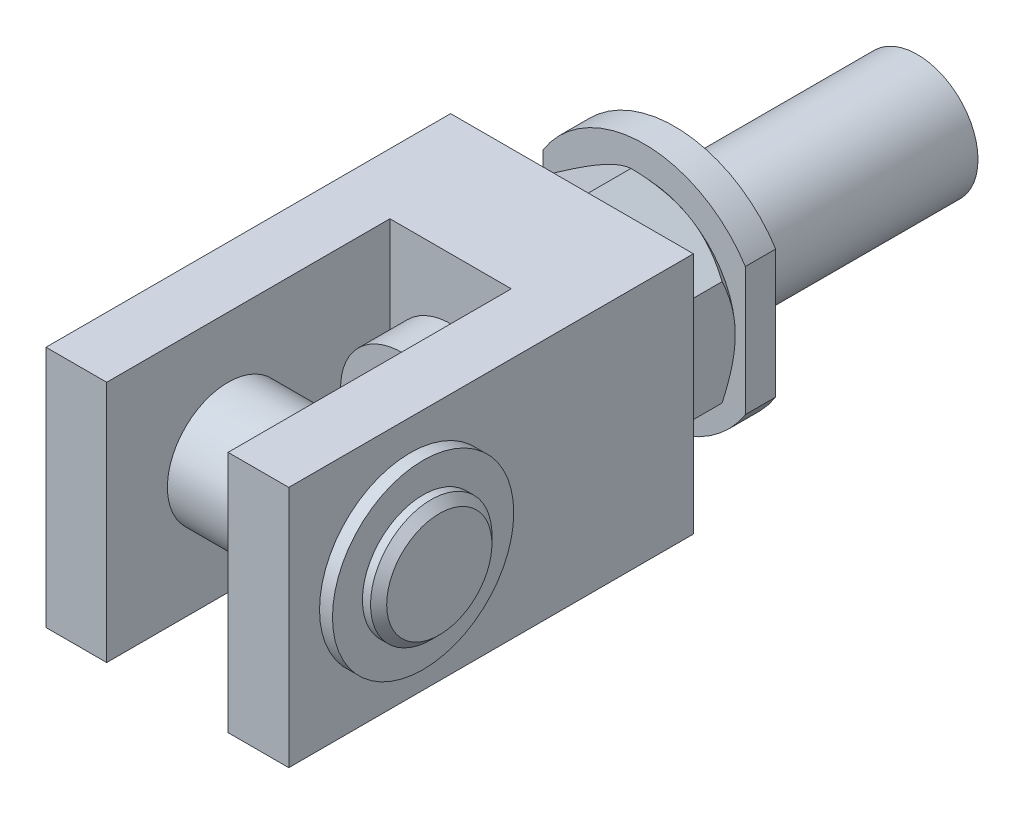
ISO-10303-21;
HEADER;
FILE_DESCRIPTION(('STEP AP214'),'2;1');
FILE_NAME('part.step','',(''),(''),'','','');
FILE_SCHEMA(('AUTOMOTIVE_DESIGN { 1 0 10303 214 1 1 1 1 }'));
ENDSEC;
DATA;
#1=APPLICATION_CONTEXT('core data for automotive mechanical design processes');
#2=APPLICATION_PROTOCOL_DEFINITION('international standard','automotive_design',2000,#1);
#3=PRODUCT_CONTEXT('',#1,'mechanical');
#4=PRODUCT('Part','Part','',(#3));
#5=PRODUCT_RELATED_PRODUCT_CATEGORY('part','',(#4));
#6=PRODUCT_DEFINITION_FORMATION('','',#4);
#7=PRODUCT_DEFINITION_CONTEXT('part definition',#1,'design');
#8=PRODUCT_DEFINITION('design','',#6,#7);
#9=PRODUCT_DEFINITION_SHAPE('','',#8);
#10=(LENGTH_UNIT() NAMED_UNIT(*) SI_UNIT(.MILLI.,.METRE.));
#11=(NAMED_UNIT(*) PLANE_ANGLE_UNIT() SI_UNIT($,.RADIAN.));
#12=(NAMED_UNIT(*) SI_UNIT($,.STERADIAN.) SOLID_ANGLE_UNIT());
#13=UNCERTAINTY_MEASURE_WITH_UNIT(LENGTH_MEASURE(1.E-05),#10,'distance_accuracy_value','');
#14=(GEOMETRIC_REPRESENTATION_CONTEXT(3) GLOBAL_UNCERTAINTY_ASSIGNED_CONTEXT((#13)) GLOBAL_UNIT_ASSIGNED_CONTEXT((#10,
#11,#12)) REPRESENTATION_CONTEXT('',''));
#15=CARTESIAN_POINT('',(0.,0.,0.));
#16=DIRECTION('',(0.,0.,1.));
#17=DIRECTION('',(1.,0.,0.));
#18=AXIS2_PLACEMENT_3D('',#15,#16,#17);
#19=CARTESIAN_POINT('',(19.05,0.,44.45));
#20=DIRECTION('',(-1.,0.,0.));
#21=DIRECTION('',(0.,0.,-1.));
#22=AXIS2_PLACEMENT_3D('',#19,#20,#21);
#23=CYLINDRICAL_SURFACE('',#22,9.525);
#24=CARTESIAN_POINT('',(9.525,0.,44.45));
#25=DIRECTION('',(-1.,0.,0.));
#26=DIRECTION('',(0.,0.,1.));
#27=AXIS2_PLACEMENT_3D('',#24,#25,#26);
#28=CIRCLE('',#27,9.525);
#29=CARTESIAN_POINT('',(9.525,0.,53.975));
#30=VERTEX_POINT('',#29);
#31=EDGE_CURVE('E19',#30,#30,#28,.F.);
#32=ORIENTED_EDGE('',*,*,#31,.F.);
#33=EDGE_LOOP('',(#32));
#34=FACE_BOUND('',#33,.T.);
#35=CARTESIAN_POINT('',(-9.525,0.,44.45));
#36=DIRECTION('',(1.,0.,0.));
#37=DIRECTION('',(0.,0.,-1.));
#38=AXIS2_PLACEMENT_3D('',#35,#36,#37);
#39=CIRCLE('',#38,9.525);
#40=CARTESIAN_POINT('',(-9.525,0.,34.925));
#41=VERTEX_POINT('',#40);
#42=EDGE_CURVE('E1007',#41,#41,#39,.F.);
#43=ORIENTED_EDGE('',*,*,#42,.F.);
#44=EDGE_LOOP('',(#43));
#45=FACE_BOUND('',#44,.T.);
#46=ADVANCED_FACE('F14',(#34,#45),#23,.T.);
#47=CARTESIAN_POINT('',(-19.05,-19.05,0.));
#48=DIRECTION('',(-1.,0.,0.));
#49=DIRECTION('',(0.,0.,1.));
#50=AXIS2_PLACEMENT_3D('',#47,#48,#49);
#51=PLANE('',#50);
#52=CARTESIAN_POINT('',(-19.05,0.,44.45));
#53=DIRECTION('',(-1.,0.,0.));
#54=DIRECTION('',(0.,0.,1.));
#55=AXIS2_PLACEMENT_3D('',#52,#53,#54);
#56=CIRCLE('',#55,11.938);
#57=CARTESIAN_POINT('',(-19.05,0.,56.388));
#58=VERTEX_POINT('',#57);
#59=EDGE_CURVE('E9',#58,#58,#56,.F.);
#60=ORIENTED_EDGE('',*,*,#59,.T.);
#61=EDGE_LOOP('',(#60));
#62=FACE_BOUND('',#61,.T.);
#63=DIRECTION('',(0.,0.,1.));
#64=VECTOR('',#63,1.);
#65=CARTESIAN_POINT('',(-19.05,19.05,0.));
#66=LINE('',#65,#64);
#67=CARTESIAN_POINT('',(-19.05,19.05,0.));
#68=VERTEX_POINT('',#67);
#69=CARTESIAN_POINT('',(-19.05,19.05,63.5));
#70=VERTEX_POINT('',#69);
#71=EDGE_CURVE('E1024',#68,#70,#66,.T.);
#72=ORIENTED_EDGE('',*,*,#71,.F.);
#73=DIRECTION('',(0.,1.,0.));
#74=VECTOR('',#73,1.);
#75=CARTESIAN_POINT('',(-19.05,-19.05,0.));
#76=LINE('',#75,#74);
#77=CARTESIAN_POINT('',(-19.05,-19.05,0.));
#78=VERTEX_POINT('',#77);
#79=EDGE_CURVE('E1003',#78,#68,#76,.T.);
#80=ORIENTED_EDGE('',*,*,#79,.F.);
#81=DIRECTION('',(0.,0.,1.));
#82=VECTOR('',#81,1.);
#83=CARTESIAN_POINT('',(-19.05,-19.05,0.));
#84=LINE('',#83,#82);
#85=CARTESIAN_POINT('',(-19.05,-19.05,63.5));
#86=VERTEX_POINT('',#85);
#87=EDGE_CURVE('E1050',#78,#86,#84,.T.);
#88=ORIENTED_EDGE('',*,*,#87,.T.);
#89=DIRECTION('',(0.,1.,0.));
#90=VECTOR('',#89,1.);
#91=CARTESIAN_POINT('',(-19.05,-19.05,63.5));
#92=LINE('',#91,#90);
#93=EDGE_CURVE('E997',#86,#70,#92,.T.);
#94=ORIENTED_EDGE('',*,*,#93,.T.);
#95=EDGE_LOOP('',(#72,#80,#88,#94));
#96=FACE_BOUND('',#95,.T.);
#97=ADVANCED_FACE('F485',(#62,#96),#51,.T.);
#98=CARTESIAN_POINT('',(-19.05,-19.05,0.));
#99=DIRECTION('',(0.,0.,-1.));
#100=DIRECTION('',(-1.,0.,0.));
#101=AXIS2_PLACEMENT_3D('',#98,#99,#100);
#102=PLANE('',#101);
#103=DIRECTION('',(-1.,0.,0.));
#104=VECTOR('',#103,1.);
#105=CARTESIAN_POINT('',(-19.05,19.05,0.));
#106=LINE('',#105,#104);
#107=CARTESIAN_POINT('',(19.05,19.05,0.));
#108=VERTEX_POINT('',#107);
#109=EDGE_CURVE('E1048',#108,#68,#106,.T.);
#110=ORIENTED_EDGE('',*,*,#109,.F.);
#111=DIRECTION('',(0.,1.,0.));
#112=VECTOR('',#111,1.);
#113=CARTESIAN_POINT('',(19.05,-19.05,0.));
#114=LINE('',#113,#112);
#115=CARTESIAN_POINT('',(19.05,-19.05,0.));
#116=VERTEX_POINT('',#115);
#117=EDGE_CURVE('E1053',#116,#108,#114,.T.);
#118=ORIENTED_EDGE('',*,*,#117,.F.);
#119=DIRECTION('',(-1.,0.,0.));
#120=VECTOR('',#119,1.);
#121=CARTESIAN_POINT('',(-19.05,-19.05,0.));
#122=LINE('',#121,#120);
#123=EDGE_CURVE('E1000',#116,#78,#122,.T.);
#124=ORIENTED_EDGE('',*,*,#123,.T.);
#125=ORIENTED_EDGE('',*,*,#79,.T.);
#126=EDGE_LOOP('',(#110,#118,#124,#125));
#127=FACE_BOUND('',#126,.T.);
#128=CARTESIAN_POINT('',(0.,0.,0.));
#129=DIRECTION('',(0.,0.,1.));
#130=DIRECTION('',(1.,0.,0.));
#131=AXIS2_PLACEMENT_3D('',#128,#129,#130);
#132=CIRCLE('',#131,14.2875);
#133=CARTESIAN_POINT('',(-7.14375,-12.3733379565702,0.));
#134=VERTEX_POINT('',#133);
#135=CARTESIAN_POINT('',(7.14375,-12.3733379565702,0.));
#136=VERTEX_POINT('',#135);
#137=EDGE_CURVE('E164',#134,#136,#132,.T.);
#138=ORIENTED_EDGE('',*,*,#137,.T.);
#139=CARTESIAN_POINT('',(14.2875,0.,0.));
#140=VERTEX_POINT('',#139);
#141=EDGE_CURVE('E25',#136,#140,#132,.T.);
#142=ORIENTED_EDGE('',*,*,#141,.T.);
#143=CARTESIAN_POINT('',(0.,0.,0.));
#144=DIRECTION('',(0.,0.,1.));
#145=DIRECTION('',(1.,0.,0.));
#146=AXIS2_PLACEMENT_3D('',#143,#144,#145);
#147=CIRCLE('',#146,14.2875);
#148=CARTESIAN_POINT('',(7.14375,12.3733379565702,0.));
#149=VERTEX_POINT('',#148);
#150=EDGE_CURVE('E34',#140,#149,#147,.T.);
#151=ORIENTED_EDGE('',*,*,#150,.T.);
#152=CARTESIAN_POINT('',(-7.14375,12.3733379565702,0.));
#153=VERTEX_POINT('',#152);
#154=EDGE_CURVE('E163',#149,#153,#132,.T.);
#155=ORIENTED_EDGE('',*,*,#154,.T.);
#156=CARTESIAN_POINT('',(-14.2875,0.,0.));
#157=VERTEX_POINT('',#156);
#158=EDGE_CURVE('E131',#153,#157,#132,.T.);
#159=ORIENTED_EDGE('',*,*,#158,.T.);
#160=EDGE_CURVE('E1098',#157,#134,#132,.T.);
#161=ORIENTED_EDGE('',*,*,#160,.T.);
#162=EDGE_LOOP('',(#138,#142,#151,#155,#159,#161));
#163=FACE_BOUND('',#162,.T.);
#164=ADVANCED_FACE('F706',(#127,#163),#102,.T.);
#165=CARTESIAN_POINT('',(9.525,-19.05,63.5));
#166=DIRECTION('',(0.,0.,1.));
#167=DIRECTION('',(1.,0.,0.));
#168=AXIS2_PLACEMENT_3D('',#165,#166,#167);
#169=PLANE('',#168);
#170=DIRECTION('',(1.,0.,0.));
#171=VECTOR('',#170,1.);
#172=CARTESIAN_POINT('',(9.525,19.05,63.5));
#173=LINE('',#172,#171);
#174=CARTESIAN_POINT('',(9.525,19.05,63.5));
#175=VERTEX_POINT('',#174);
#176=CARTESIAN_POINT('',(19.05,19.05,63.5));
#177=VERTEX_POINT('',#176);
#178=EDGE_CURVE('E1042',#175,#177,#173,.T.);
#179=ORIENTED_EDGE('',*,*,#178,.F.);
#180=DIRECTION('',(0.,1.,0.));
#181=VECTOR('',#180,1.);
#182=CARTESIAN_POINT('',(9.525,-19.05,63.5));
#183=LINE('',#182,#181);
#184=CARTESIAN_POINT('',(9.525,-19.05,63.5));
#185=VERTEX_POINT('',#184);
#186=EDGE_CURVE('E988',#185,#175,#183,.T.);
#187=ORIENTED_EDGE('',*,*,#186,.F.);
#188=DIRECTION('',(1.,0.,0.));
#189=VECTOR('',#188,1.);
#190=CARTESIAN_POINT('',(9.525,-19.05,63.5));
#191=LINE('',#190,#189);
#192=CARTESIAN_POINT('',(19.05,-19.05,63.5));
#193=VERTEX_POINT('',#192);
#194=EDGE_CURVE('E1111',#185,#193,#191,.T.);
#195=ORIENTED_EDGE('',*,*,#194,.T.);
#196=DIRECTION('',(0.,1.,0.));
#197=VECTOR('',#196,1.);
#198=CARTESIAN_POINT('',(19.05,-19.05,63.5));
#199=LINE('',#198,#197);
#200=EDGE_CURVE('E1055',#193,#177,#199,.T.);
#201=ORIENTED_EDGE('',*,*,#200,.T.);
#202=EDGE_LOOP('',(#179,#187,#195,#201));
#203=FACE_BOUND('',#202,.T.);
#204=ADVANCED_FACE('F765',(#203),#169,.T.);
#205=CARTESIAN_POINT('',(9.525,-19.05,19.05));
#206=DIRECTION('',(-1.,0.,0.));
#207=DIRECTION('',(0.,0.,1.));
#208=AXIS2_PLACEMENT_3D('',#205,#206,#207);
#209=PLANE('',#208);
#210=DIRECTION('',(0.,0.,1.));
#211=VECTOR('',#210,1.);
#212=CARTESIAN_POINT('',(9.525,-0.492032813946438,-38.3050893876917));
#213=LINE('',#212,#211);
#214=CARTESIAN_POINT('',(9.525,-0.492032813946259,19.05));
#215=VERTEX_POINT('',#214);
#216=CARTESIAN_POINT('',(9.525,-0.492032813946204,26.7716));
#217=VERTEX_POINT('',#216);
#218=EDGE_CURVE('E170',#215,#217,#213,.T.);
#219=ORIENTED_EDGE('',*,*,#218,.F.);
#220=DIRECTION('',(0.,1.,0.));
#221=VECTOR('',#220,1.);
#222=CARTESIAN_POINT('',(9.525,-19.05,19.05));
#223=LINE('',#222,#221);
#224=CARTESIAN_POINT('',(9.525,-19.05,19.05));
#225=VERTEX_POINT('',#224);
#226=EDGE_CURVE('E985',#225,#215,#223,.T.);
#227=ORIENTED_EDGE('',*,*,#226,.F.);
#228=DIRECTION('',(0.,0.,1.));
#229=VECTOR('',#228,1.);
#230=CARTESIAN_POINT('',(9.525,-19.05,19.05));
#231=LINE('',#230,#229);
#232=EDGE_CURVE('E1067',#225,#185,#231,.T.);
#233=ORIENTED_EDGE('',*,*,#232,.T.);
#234=ORIENTED_EDGE('',*,*,#186,.T.);
#235=DIRECTION('',(0.,0.,1.));
#236=VECTOR('',#235,1.);
#237=CARTESIAN_POINT('',(9.525,19.05,19.05));
#238=LINE('',#237,#236);
#239=CARTESIAN_POINT('',(9.525,19.05,19.05));
#240=VERTEX_POINT('',#239);
#241=EDGE_CURVE('E983',#240,#175,#238,.T.);
#242=ORIENTED_EDGE('',*,*,#241,.F.);
#243=CARTESIAN_POINT('',(9.525,0.492032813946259,19.05));
#244=VERTEX_POINT('',#243);
#245=EDGE_CURVE('E974',#244,#240,#223,.T.);
#246=ORIENTED_EDGE('',*,*,#245,.F.);
#247=DIRECTION('',(0.,0.,1.));
#248=VECTOR('',#247,1.);
#249=CARTESIAN_POINT('',(9.525,0.492032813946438,-38.3050893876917));
#250=LINE('',#249,#248);
#251=CARTESIAN_POINT('',(9.525,0.492032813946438,26.7716));
#252=VERTEX_POINT('',#251);
#253=EDGE_CURVE('E168',#252,#244,#250,.F.);
#254=ORIENTED_EDGE('',*,*,#253,.F.);
#255=DIRECTION('',(0.,-1.,0.));
#256=VECTOR('',#255,1.);
#257=CARTESIAN_POINT('',(9.525,-19.05,26.7716));
#258=LINE('',#257,#256);
#259=EDGE_CURVE('E173',#252,#217,#258,.T.);
#260=ORIENTED_EDGE('',*,*,#259,.T.);
#261=EDGE_LOOP('',(#219,#227,#233,#234,#242,#246,#254,#260));
#262=FACE_BOUND('',#261,.T.);
#263=ORIENTED_EDGE('',*,*,#31,.T.);
#264=EDGE_LOOP('',(#263));
#265=FACE_BOUND('',#264,.T.);
#266=ADVANCED_FACE('F181',(#262,#265),#209,.T.);
#267=CARTESIAN_POINT('',(-9.525,-19.05,19.05));
#268=DIRECTION('',(0.,0.,1.));
#269=DIRECTION('',(1.,0.,0.));
#270=AXIS2_PLACEMENT_3D('',#267,#268,#269);
#271=PLANE('',#270);
#272=CARTESIAN_POINT('',(0.,0.,19.05));
#273=DIRECTION('',(0.,0.,1.));
#274=DIRECTION('',(1.,0.,0.));
#275=AXIS2_PLACEMENT_3D('',#272,#273,#274);
#276=CIRCLE('',#275,9.5377);
#277=CARTESIAN_POINT('',(-9.525,-0.492032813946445,19.05));
#278=VERTEX_POINT('',#277);
#279=EDGE_CURVE('E169',#278,#215,#276,.T.);
#280=ORIENTED_EDGE('',*,*,#279,.F.);
#281=DIRECTION('',(0.,1.,0.));
#282=VECTOR('',#281,1.);
#283=CARTESIAN_POINT('',(-9.525,-19.05,19.05));
#284=LINE('',#283,#282);
#285=CARTESIAN_POINT('',(-9.525,-19.05,19.05));
#286=VERTEX_POINT('',#285);
#287=EDGE_CURVE('E986',#286,#278,#284,.T.);
#288=ORIENTED_EDGE('',*,*,#287,.F.);
#289=DIRECTION('',(1.,0.,0.));
#290=VECTOR('',#289,1.);
#291=CARTESIAN_POINT('',(-9.525,-19.05,19.05));
#292=LINE('',#291,#290);
#293=EDGE_CURVE('E1106',#286,#225,#292,.T.);
#294=ORIENTED_EDGE('',*,*,#293,.T.);
#295=ORIENTED_EDGE('',*,*,#226,.T.);
#296=EDGE_LOOP('',(#280,#288,#294,#295));
#297=FACE_BOUND('',#296,.T.);
#298=ADVANCED_FACE('F749',(#297),#271,.T.);
#299=CARTESIAN_POINT('',(-19.05,-19.05,0.));
#300=DIRECTION('',(0.,1.,0.));
#301=DIRECTION('',(0.,0.,1.));
#302=AXIS2_PLACEMENT_3D('',#299,#300,#301);
#303=PLANE('',#302);
#304=ORIENTED_EDGE('',*,*,#87,.F.);
#305=ORIENTED_EDGE('',*,*,#123,.F.);
#306=DIRECTION('',(0.,0.,-1.));
#307=VECTOR('',#306,1.);
#308=CARTESIAN_POINT('',(19.05,-19.05,0.));
#309=LINE('',#308,#307);
#310=EDGE_CURVE('E1113',#193,#116,#309,.T.);
#311=ORIENTED_EDGE('',*,*,#310,.F.);
#312=ORIENTED_EDGE('',*,*,#194,.F.);
#313=ORIENTED_EDGE('',*,*,#232,.F.);
#314=ORIENTED_EDGE('',*,*,#293,.F.);
#315=DIRECTION('',(0.,0.,-1.));
#316=VECTOR('',#315,1.);
#317=CARTESIAN_POINT('',(-9.525,-19.05,63.5));
#318=LINE('',#317,#316);
#319=CARTESIAN_POINT('',(-9.525,-19.05,63.5));
#320=VERTEX_POINT('',#319);
#321=EDGE_CURVE('E1115',#320,#286,#318,.T.);
#322=ORIENTED_EDGE('',*,*,#321,.F.);
#323=DIRECTION('',(1.,0.,0.));
#324=VECTOR('',#323,1.);
#325=CARTESIAN_POINT('',(-19.05,-19.05,63.5));
#326=LINE('',#325,#324);
#327=EDGE_CURVE('E1139',#86,#320,#326,.T.);
#328=ORIENTED_EDGE('',*,*,#327,.F.);
#329=EDGE_LOOP('',(#304,#305,#311,#312,#313,#314,#322,#328));
#330=FACE_BOUND('',#329,.T.);
#331=ADVANCED_FACE('F723',(#330),#303,.F.);
#332=CARTESIAN_POINT('',(-19.05,-19.05,63.5));
#333=DIRECTION('',(0.,0.,1.));
#334=DIRECTION('',(1.,0.,0.));
#335=AXIS2_PLACEMENT_3D('',#332,#333,#334);
#336=PLANE('',#335);
#337=DIRECTION('',(1.,0.,0.));
#338=VECTOR('',#337,1.);
#339=CARTESIAN_POINT('',(-19.05,19.05,63.5));
#340=LINE('',#339,#338);
#341=CARTESIAN_POINT('',(-9.525,19.05,63.5));
#342=VERTEX_POINT('',#341);
#343=EDGE_CURVE('E1027',#70,#342,#340,.T.);
#344=ORIENTED_EDGE('',*,*,#343,.F.);
#345=ORIENTED_EDGE('',*,*,#93,.F.);
#346=ORIENTED_EDGE('',*,*,#327,.T.);
#347=DIRECTION('',(0.,1.,0.));
#348=VECTOR('',#347,1.);
#349=CARTESIAN_POINT('',(-9.525,-19.05,63.5));
#350=LINE('',#349,#348);
#351=EDGE_CURVE('E994',#320,#342,#350,.T.);
#352=ORIENTED_EDGE('',*,*,#351,.T.);
#353=EDGE_LOOP('',(#344,#345,#346,#352));
#354=FACE_BOUND('',#353,.T.);
#355=ADVANCED_FACE('F716',(#354),#336,.T.);
#356=CARTESIAN_POINT('',(-19.05,19.05,0.));
#357=DIRECTION('',(0.,1.,0.));
#358=DIRECTION('',(0.,0.,1.));
#359=AXIS2_PLACEMENT_3D('',#356,#357,#358);
#360=PLANE('',#359);
#361=ORIENTED_EDGE('',*,*,#71,.T.);
#362=ORIENTED_EDGE('',*,*,#343,.T.);
#363=DIRECTION('',(0.,0.,-1.));
#364=VECTOR('',#363,1.);
#365=CARTESIAN_POINT('',(-9.525,19.05,63.5));
#366=LINE('',#365,#364);
#367=CARTESIAN_POINT('',(-9.525,19.05,19.05));
#368=VERTEX_POINT('',#367);
#369=EDGE_CURVE('E1032',#342,#368,#366,.T.);
#370=ORIENTED_EDGE('',*,*,#369,.T.);
#371=DIRECTION('',(1.,0.,0.));
#372=VECTOR('',#371,1.);
#373=CARTESIAN_POINT('',(-9.525,19.05,19.05));
#374=LINE('',#373,#372);
#375=EDGE_CURVE('E1039',#368,#240,#374,.T.);
#376=ORIENTED_EDGE('',*,*,#375,.T.);
#377=ORIENTED_EDGE('',*,*,#241,.T.);
#378=ORIENTED_EDGE('',*,*,#178,.T.);
#379=DIRECTION('',(0.,0.,-1.));
#380=VECTOR('',#379,1.);
#381=CARTESIAN_POINT('',(19.05,19.05,0.));
#382=LINE('',#381,#380);
#383=EDGE_CURVE('E1045',#177,#108,#382,.T.);
#384=ORIENTED_EDGE('',*,*,#383,.T.);
#385=ORIENTED_EDGE('',*,*,#109,.T.);
#386=EDGE_LOOP('',(#361,#362,#370,#376,#377,#378,#384,#385));
#387=FACE_BOUND('',#386,.T.);
#388=ADVANCED_FACE('F722',(#387),#360,.T.);
#389=CARTESIAN_POINT('',(-9.525,0.492032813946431,19.05));
#390=VERTEX_POINT('',#389);
#391=EDGE_CURVE('E165',#244,#390,#276,.T.);
#392=ORIENTED_EDGE('',*,*,#391,.F.);
#393=ORIENTED_EDGE('',*,*,#245,.T.);
#394=ORIENTED_EDGE('',*,*,#375,.F.);
#395=EDGE_CURVE('E978',#390,#368,#284,.T.);
#396=ORIENTED_EDGE('',*,*,#395,.F.);
#397=EDGE_LOOP('',(#392,#393,#394,#396));
#398=FACE_BOUND('',#397,.T.);
#399=ADVANCED_FACE('F739',(#398),#271,.T.);
#400=CARTESIAN_POINT('',(-9.525,-19.05,63.5));
#401=DIRECTION('',(1.,0.,0.));
#402=DIRECTION('',(0.,0.,-1.));
#403=AXIS2_PLACEMENT_3D('',#400,#401,#402);
#404=PLANE('',#403);
#405=DIRECTION('',(0.,0.,1.));
#406=VECTOR('',#405,1.);
#407=CARTESIAN_POINT('',(-9.525,0.492032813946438,-38.3050893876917));
#408=LINE('',#407,#406);
#409=CARTESIAN_POINT('',(-9.525,0.492032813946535,26.7716));
#410=VERTEX_POINT('',#409);
#411=EDGE_CURVE('E1005',#390,#410,#408,.T.);
#412=ORIENTED_EDGE('',*,*,#411,.F.);
#413=ORIENTED_EDGE('',*,*,#395,.T.);
#414=ORIENTED_EDGE('',*,*,#369,.F.);
#415=ORIENTED_EDGE('',*,*,#351,.F.);
#416=ORIENTED_EDGE('',*,*,#321,.T.);
#417=ORIENTED_EDGE('',*,*,#287,.T.);
#418=DIRECTION('',(0.,0.,1.));
#419=VECTOR('',#418,1.);
#420=CARTESIAN_POINT('',(-9.525,-0.492032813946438,-38.3050893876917));
#421=LINE('',#420,#419);
#422=CARTESIAN_POINT('',(-9.525,-0.492032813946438,26.7716));
#423=VERTEX_POINT('',#422);
#424=EDGE_CURVE('E1001',#423,#278,#421,.F.);
#425=ORIENTED_EDGE('',*,*,#424,.F.);
#426=DIRECTION('',(0.,1.,0.));
#427=VECTOR('',#426,1.);
#428=CARTESIAN_POINT('',(-9.525,-19.05,26.7716));
#429=LINE('',#428,#427);
#430=EDGE_CURVE('E204',#423,#410,#429,.T.);
#431=ORIENTED_EDGE('',*,*,#430,.T.);
#432=EDGE_LOOP('',(#412,#413,#414,#415,#416,#417,#425,#431));
#433=FACE_BOUND('',#432,.T.);
#434=ORIENTED_EDGE('',*,*,#42,.T.);
#435=EDGE_LOOP('',(#434));
#436=FACE_BOUND('',#435,.T.);
#437=ADVANCED_FACE('F733',(#433,#436),#404,.T.);
#438=CARTESIAN_POINT('',(19.05,-19.05,0.));
#439=DIRECTION('',(1.,0.,0.));
#440=DIRECTION('',(0.,0.,-1.));
#441=AXIS2_PLACEMENT_3D('',#438,#439,#440);
#442=PLANE('',#441);
#443=CARTESIAN_POINT('',(19.05,0.,44.45));
#444=DIRECTION('',(1.,0.,0.));
#445=DIRECTION('',(0.,0.,-1.));
#446=AXIS2_PLACEMENT_3D('',#443,#444,#445);
#447=CIRCLE('',#446,14.224);
#448=CARTESIAN_POINT('',(19.05,0.,30.226));
#449=VERTEX_POINT('',#448);
#450=EDGE_CURVE('E1010',#449,#449,#447,.F.);
#451=ORIENTED_EDGE('',*,*,#450,.T.);
#452=EDGE_LOOP('',(#451));
#453=FACE_BOUND('',#452,.T.);
#454=ORIENTED_EDGE('',*,*,#383,.F.);
#455=ORIENTED_EDGE('',*,*,#200,.F.);
#456=ORIENTED_EDGE('',*,*,#310,.T.);
#457=ORIENTED_EDGE('',*,*,#117,.T.);
#458=EDGE_LOOP('',(#454,#455,#456,#457));
#459=FACE_BOUND('',#458,.T.);
#460=ADVANCED_FACE('F443',(#453,#459),#442,.T.);
#461=CARTESIAN_POINT('',(-23.114,0.,44.45));
#462=DIRECTION('',(-1.,0.,0.));
#463=DIRECTION('',(0.,0.,-1.));
#464=AXIS2_PLACEMENT_3D('',#461,#462,#463);
#465=PLANE('',#464);
#466=CARTESIAN_POINT('',(-23.114,0.,44.45));
#467=DIRECTION('',(-1.,0.,0.));
#468=DIRECTION('',(0.,0.,-1.));
#469=AXIS2_PLACEMENT_3D('',#466,#467,#468);
#470=CIRCLE('',#469,11.938);
#471=CARTESIAN_POINT('',(-23.114,0.,32.512));
#472=VERTEX_POINT('',#471);
#473=EDGE_CURVE('E1018',#472,#472,#470,.T.);
#474=ORIENTED_EDGE('',*,*,#473,.T.);
#475=EDGE_LOOP('',(#474));
#476=FACE_BOUND('',#475,.T.);
#477=ADVANCED_FACE('F436',(#476),#465,.T.);
#478=CARTESIAN_POINT('',(-23.114,0.,44.45));
#479=DIRECTION('',(1.,0.,0.));
#480=DIRECTION('',(0.,0.,1.));
#481=AXIS2_PLACEMENT_3D('',#478,#479,#480);
#482=CYLINDRICAL_SURFACE('',#481,11.938);
#483=ORIENTED_EDGE('',*,*,#473,.F.);
#484=EDGE_LOOP('',(#483));
#485=FACE_BOUND('',#484,.T.);
#486=ORIENTED_EDGE('',*,*,#59,.F.);
#487=EDGE_LOOP('',(#486));
#488=FACE_BOUND('',#487,.T.);
#489=ADVANCED_FACE('F429',(#485,#488),#482,.T.);
#490=CARTESIAN_POINT('',(0.,0.,26.7716));
#491=DIRECTION('',(0.,0.,-1.));
#492=DIRECTION('',(-1.,0.,0.));
#493=AXIS2_PLACEMENT_3D('',#490,#491,#492);
#494=PLANE('',#493);
#495=ORIENTED_EDGE('',*,*,#259,.F.);
#496=CARTESIAN_POINT('',(0.,0.,26.7716));
#497=DIRECTION('',(0.,0.,1.));
#498=DIRECTION('',(1.,0.,0.));
#499=AXIS2_PLACEMENT_3D('',#496,#497,#498);
#500=CIRCLE('',#499,9.5377);
#501=EDGE_CURVE('E205',#252,#410,#500,.T.);
#502=ORIENTED_EDGE('',*,*,#501,.T.);
#503=ORIENTED_EDGE('',*,*,#430,.F.);
#504=EDGE_CURVE('E199',#423,#217,#500,.T.);
#505=ORIENTED_EDGE('',*,*,#504,.T.);
#506=EDGE_LOOP('',(#495,#502,#503,#505));
#507=FACE_BOUND('',#506,.T.);
#508=ADVANCED_FACE('F202',(#507),#494,.F.);
#509=CARTESIAN_POINT('',(0.,0.,-38.3050893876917));
#510=DIRECTION('',(0.,0.,1.));
#511=DIRECTION('',(1.,0.,0.));
#512=AXIS2_PLACEMENT_3D('',#509,#510,#511);
#513=CYLINDRICAL_SURFACE('',#512,9.5377);
#514=ORIENTED_EDGE('',*,*,#279,.T.);
#515=ORIENTED_EDGE('',*,*,#218,.T.);
#516=ORIENTED_EDGE('',*,*,#504,.F.);
#517=ORIENTED_EDGE('',*,*,#424,.T.);
#518=EDGE_LOOP('',(#514,#515,#516,#517));
#519=FACE_BOUND('',#518,.T.);
#520=ADVANCED_FACE('F196',(#519),#513,.T.);
#521=ORIENTED_EDGE('',*,*,#501,.F.);
#522=ORIENTED_EDGE('',*,*,#253,.T.);
#523=ORIENTED_EDGE('',*,*,#391,.T.);
#524=ORIENTED_EDGE('',*,*,#411,.T.);
#525=EDGE_LOOP('',(#521,#522,#523,#524));
#526=FACE_BOUND('',#525,.T.);
#527=ADVANCED_FACE('F434',(#526),#513,.T.);
#528=CARTESIAN_POINT('',(0.,9.525,-54.1909));
#529=DIRECTION('',(0.,0.,1.));
#530=DIRECTION('',(1.,0.,0.));
#531=AXIS2_PLACEMENT_3D('',#528,#529,#530);
#532=PLANE('',#531);
#533=CARTESIAN_POINT('',(0.,0.,-54.1909));
#534=DIRECTION('',(0.,0.,1.));
#535=DIRECTION('',(1.,0.,0.));
#536=AXIS2_PLACEMENT_3D('',#533,#534,#535);
#537=CIRCLE('',#536,9.525);
#538=CARTESIAN_POINT('',(9.525,0.,-54.1909));
#539=VERTEX_POINT('',#538);
#540=EDGE_CURVE('E234',#539,#539,#537,.T.);
#541=ORIENTED_EDGE('',*,*,#540,.F.);
#542=EDGE_LOOP('',(#541));
#543=FACE_BOUND('',#542,.T.);
#544=ADVANCED_FACE('F468',(#543),#532,.F.);
#545=CARTESIAN_POINT('',(0.,0.,37.5006148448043));
#546=DIRECTION('',(0.,0.,1.));
#547=DIRECTION('',(1.,0.,0.));
#548=AXIS2_PLACEMENT_3D('',#545,#546,#547);
#549=CYLINDRICAL_SURFACE('',#548,9.525);
#550=CARTESIAN_POINT('',(0.,0.,-16.0909));
#551=DIRECTION('',(0.,0.,1.));
#552=DIRECTION('',(1.,0.,0.));
#553=AXIS2_PLACEMENT_3D('',#550,#551,#552);
#554=CIRCLE('',#553,9.525);
#555=CARTESIAN_POINT('',(9.525,0.,-16.0909));
#556=VERTEX_POINT('',#555);
#557=EDGE_CURVE('E237',#556,#556,#554,.T.);
#558=ORIENTED_EDGE('',*,*,#557,.F.);
#559=EDGE_LOOP('',(#558));
#560=FACE_BOUND('',#559,.T.);
#561=ORIENTED_EDGE('',*,*,#540,.T.);
#562=EDGE_LOOP('',(#561));
#563=FACE_BOUND('',#562,.T.);
#564=ADVANCED_FACE('F472',(#560,#563),#549,.T.);
#565=CARTESIAN_POINT('',(0.,18.796,-16.0909));
#566=DIRECTION('',(0.,0.,1.));
#567=DIRECTION('',(1.,0.,0.));
#568=AXIS2_PLACEMENT_3D('',#565,#566,#567);
#569=PLANE('',#568);
#570=CARTESIAN_POINT('',(0.,0.,-16.0909));
#571=DIRECTION('',(0.,0.,1.));
#572=DIRECTION('',(1.,0.,0.));
#573=AXIS2_PLACEMENT_3D('',#570,#571,#572);
#574=CIRCLE('',#573,18.796);
#575=CARTESIAN_POINT('',(15.875,10.063497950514,-16.0909));
#576=VERTEX_POINT('',#575);
#577=CARTESIAN_POINT('',(-15.875,10.063497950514,-16.0909));
#578=VERTEX_POINT('',#577);
#579=EDGE_CURVE('E240',#576,#578,#574,.T.);
#580=ORIENTED_EDGE('',*,*,#579,.F.);
#581=DIRECTION('',(0.,1.,0.));
#582=VECTOR('',#581,1.);
#583=CARTESIAN_POINT('',(15.875,10.063497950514,-16.0909));
#584=LINE('',#583,#582);
#585=CARTESIAN_POINT('',(15.875,-10.063497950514,-16.0909));
#586=VERTEX_POINT('',#585);
#587=EDGE_CURVE('E221',#586,#576,#584,.T.);
#588=ORIENTED_EDGE('',*,*,#587,.F.);
#589=CARTESIAN_POINT('',(-15.875,-10.063497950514,-16.0909));
#590=VERTEX_POINT('',#589);
#591=EDGE_CURVE('E241',#590,#586,#574,.T.);
#592=ORIENTED_EDGE('',*,*,#591,.F.);
#593=DIRECTION('',(0.,-1.,0.));
#594=VECTOR('',#593,1.);
#595=CARTESIAN_POINT('',(-15.875,10.063497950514,-16.0909));
#596=LINE('',#595,#594);
#597=EDGE_CURVE('E231',#578,#590,#596,.T.);
#598=ORIENTED_EDGE('',*,*,#597,.F.);
#599=EDGE_LOOP('',(#580,#588,#592,#598));
#600=FACE_BOUND('',#599,.T.);
#601=ORIENTED_EDGE('',*,*,#557,.T.);
#602=EDGE_LOOP('',(#601));
#603=FACE_BOUND('',#602,.T.);
#604=ADVANCED_FACE('F464',(#600,#603),#569,.F.);
#605=CARTESIAN_POINT('',(-15.875,10.063497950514,-54.1919));
#606=DIRECTION('',(1.,0.,0.));
#607=DIRECTION('',(0.,1.,0.));
#608=AXIS2_PLACEMENT_3D('',#605,#606,#607);
#609=PLANE('',#608);
#610=ORIENTED_EDGE('',*,*,#597,.T.);
#611=DIRECTION('',(0.,0.,1.));
#612=VECTOR('',#611,1.);
#613=CARTESIAN_POINT('',(-15.875,-10.063497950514,-54.1919));
#614=LINE('',#613,#612);
#615=CARTESIAN_POINT('',(-15.875,-10.063497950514,-11.3284));
#616=VERTEX_POINT('',#615);
#617=EDGE_CURVE('E227',#590,#616,#614,.T.);
#618=ORIENTED_EDGE('',*,*,#617,.T.);
#619=DIRECTION('',(0.,1.,0.));
#620=VECTOR('',#619,1.);
#621=CARTESIAN_POINT('',(-15.875,10.063497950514,-11.3284));
#622=LINE('',#621,#620);
#623=CARTESIAN_POINT('',(-15.875,10.063497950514,-11.3284));
#624=VERTEX_POINT('',#623);
#625=EDGE_CURVE('E224',#616,#624,#622,.T.);
#626=ORIENTED_EDGE('',*,*,#625,.T.);
#627=DIRECTION('',(0.,0.,1.));
#628=VECTOR('',#627,1.);
#629=CARTESIAN_POINT('',(-15.875,10.063497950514,-54.1919));
#630=LINE('',#629,#628);
#631=EDGE_CURVE('E228',#578,#624,#630,.T.);
#632=ORIENTED_EDGE('',*,*,#631,.F.);
#633=EDGE_LOOP('',(#610,#618,#626,#632));
#634=FACE_BOUND('',#633,.T.);
#635=ADVANCED_FACE('F454',(#634),#609,.F.);
#636=CARTESIAN_POINT('',(0.,0.,37.5006148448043));
#637=DIRECTION('',(0.,0.,1.));
#638=DIRECTION('',(1.,0.,0.));
#639=AXIS2_PLACEMENT_3D('',#636,#637,#638);
#640=CYLINDRICAL_SURFACE('',#639,18.796);
#641=CARTESIAN_POINT('',(0.,0.,-11.3284));
#642=DIRECTION('',(0.,0.,1.));
#643=DIRECTION('',(1.,0.,0.));
#644=AXIS2_PLACEMENT_3D('',#641,#642,#643);
#645=CIRCLE('',#644,18.796);
#646=CARTESIAN_POINT('',(15.875,10.063497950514,-11.3284));
#647=VERTEX_POINT('',#646);
#648=EDGE_CURVE('E244',#647,#624,#645,.T.);
#649=ORIENTED_EDGE('',*,*,#648,.F.);
#650=DIRECTION('',(0.,0.,1.));
#651=VECTOR('',#650,1.);
#652=CARTESIAN_POINT('',(15.875,10.063497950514,-54.1919));
#653=LINE('',#652,#651);
#654=EDGE_CURVE('E217',#576,#647,#653,.T.);
#655=ORIENTED_EDGE('',*,*,#654,.F.);
#656=ORIENTED_EDGE('',*,*,#579,.T.);
#657=ORIENTED_EDGE('',*,*,#631,.T.);
#658=EDGE_LOOP('',(#649,#655,#656,#657));
#659=FACE_BOUND('',#658,.T.);
#660=ADVANCED_FACE('F451',(#659),#640,.T.);
#661=CARTESIAN_POINT('',(15.875,10.063497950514,-54.1919));
#662=DIRECTION('',(-1.,0.,0.));
#663=DIRECTION('',(0.,-1.,0.));
#664=AXIS2_PLACEMENT_3D('',#661,#662,#663);
#665=PLANE('',#664);
#666=ORIENTED_EDGE('',*,*,#587,.T.);
#667=ORIENTED_EDGE('',*,*,#654,.T.);
#668=DIRECTION('',(0.,-1.,0.));
#669=VECTOR('',#668,1.);
#670=CARTESIAN_POINT('',(15.875,10.063497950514,-11.3284));
#671=LINE('',#670,#669);
#672=CARTESIAN_POINT('',(15.875,-10.063497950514,-11.3284));
#673=VERTEX_POINT('',#672);
#674=EDGE_CURVE('E208',#647,#673,#671,.T.);
#675=ORIENTED_EDGE('',*,*,#674,.T.);
#676=DIRECTION('',(0.,0.,1.));
#677=VECTOR('',#676,1.);
#678=CARTESIAN_POINT('',(15.875,-10.063497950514,-54.1919));
#679=LINE('',#678,#677);
#680=EDGE_CURVE('E218',#586,#673,#679,.T.);
#681=ORIENTED_EDGE('',*,*,#680,.F.);
#682=EDGE_LOOP('',(#666,#667,#675,#681));
#683=FACE_BOUND('',#682,.T.);
#684=ADVANCED_FACE('F439',(#683),#665,.F.);
#685=ORIENTED_EDGE('',*,*,#591,.T.);
#686=ORIENTED_EDGE('',*,*,#680,.T.);
#687=EDGE_CURVE('E245',#616,#673,#645,.T.);
#688=ORIENTED_EDGE('',*,*,#687,.F.);
#689=ORIENTED_EDGE('',*,*,#617,.F.);
#690=EDGE_LOOP('',(#685,#686,#688,#689));
#691=FACE_BOUND('',#690,.T.);
#692=ADVANCED_FACE('F450',(#691),#640,.T.);
#693=CARTESIAN_POINT('',(0.,9.525,-11.3284));
#694=DIRECTION('',(0.,0.,-1.));
#695=DIRECTION('',(-1.,0.,0.));
#696=AXIS2_PLACEMENT_3D('',#693,#694,#695);
#697=PLANE('',#696);
#698=CARTESIAN_POINT('',(0.,0.,-11.3284));
#699=DIRECTION('',(0.,0.,-1.));
#700=DIRECTION('',(-1.,0.,0.));
#701=AXIS2_PLACEMENT_3D('',#698,#699,#700);
#702=CIRCLE('',#701,14.2875);
#703=CARTESIAN_POINT('',(14.2875,0.,-11.3284));
#704=VERTEX_POINT('',#703);
#705=CARTESIAN_POINT('',(7.14375,12.3733379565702,-11.3284));
#706=VERTEX_POINT('',#705);
#707=EDGE_CURVE('E261',#704,#706,#702,.F.);
#708=ORIENTED_EDGE('',*,*,#707,.F.);
#709=CARTESIAN_POINT('',(0.,0.,-11.3284));
#710=DIRECTION('',(0.,0.,-1.));
#711=DIRECTION('',(-1.,0.,0.));
#712=AXIS2_PLACEMENT_3D('',#709,#710,#711);
#713=CIRCLE('',#712,14.2875);
#714=CARTESIAN_POINT('',(7.14375,-12.3733379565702,-11.3284));
#715=VERTEX_POINT('',#714);
#716=EDGE_CURVE('E248',#715,#704,#713,.F.);
#717=ORIENTED_EDGE('',*,*,#716,.F.);
#718=CARTESIAN_POINT('',(0.,0.,-11.3284));
#719=DIRECTION('',(0.,0.,-1.));
#720=DIRECTION('',(-1.,0.,0.));
#721=AXIS2_PLACEMENT_3D('',#718,#719,#720);
#722=CIRCLE('',#721,14.2875);
#723=CARTESIAN_POINT('',(-7.14375,-12.3733379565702,-11.3284));
#724=VERTEX_POINT('',#723);
#725=EDGE_CURVE('E250',#724,#715,#722,.F.);
#726=ORIENTED_EDGE('',*,*,#725,.F.);
#727=CARTESIAN_POINT('',(0.,0.,-11.3284));
#728=DIRECTION('',(0.,0.,-1.));
#729=DIRECTION('',(-1.,0.,0.));
#730=AXIS2_PLACEMENT_3D('',#727,#728,#729);
#731=CIRCLE('',#730,14.2875);
#732=CARTESIAN_POINT('',(-14.2875,0.,-11.3284));
#733=VERTEX_POINT('',#732);
#734=EDGE_CURVE('E252',#733,#724,#731,.F.);
#735=ORIENTED_EDGE('',*,*,#734,.F.);
#736=CARTESIAN_POINT('',(0.,0.,-11.3284));
#737=DIRECTION('',(0.,0.,-1.));
#738=DIRECTION('',(-1.,0.,0.));
#739=AXIS2_PLACEMENT_3D('',#736,#737,#738);
#740=CIRCLE('',#739,14.2875);
#741=CARTESIAN_POINT('',(-7.14375,12.3733379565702,-11.3284));
#742=VERTEX_POINT('',#741);
#743=EDGE_CURVE('E255',#742,#733,#740,.F.);
#744=ORIENTED_EDGE('',*,*,#743,.F.);
#745=CARTESIAN_POINT('',(0.,0.,-11.3284));
#746=DIRECTION('',(0.,0.,-1.));
#747=DIRECTION('',(-1.,0.,0.));
#748=AXIS2_PLACEMENT_3D('',#745,#746,#747);
#749=CIRCLE('',#748,14.2875);
#750=EDGE_CURVE('E258',#706,#742,#749,.F.);
#751=ORIENTED_EDGE('',*,*,#750,.F.);
#752=EDGE_LOOP('',(#708,#717,#726,#735,#744,#751));
#753=FACE_BOUND('',#752,.T.);
#754=ORIENTED_EDGE('',*,*,#687,.T.);
#755=ORIENTED_EDGE('',*,*,#674,.F.);
#756=ORIENTED_EDGE('',*,*,#648,.T.);
#757=ORIENTED_EDGE('',*,*,#625,.F.);
#758=EDGE_LOOP('',(#754,#755,#756,#757));
#759=FACE_BOUND('',#758,.T.);
#760=ADVANCED_FACE('F459',(#753,#759),#697,.F.);
#761=CARTESIAN_POINT('',(0.,0.,-11.3284));
#762=DIRECTION('',(0.,0.,1.));
#763=DIRECTION('',(1.,0.,0.));
#764=AXIS2_PLACEMENT_3D('',#761,#762,#763);
#765=CONICAL_SURFACE('',#764,14.2875,0.819669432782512);
#766=CARTESIAN_POINT('',(0.000200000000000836,-16.4978994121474,-9.26454218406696));
#767=CARTESIAN_POINT('',(-0.260725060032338,-16.3472542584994,-9.40517874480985));
#768=CARTESIAN_POINT('',(-0.523597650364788,-16.1954846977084,-9.54113355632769));
#769=CARTESIAN_POINT('',(-1.05352290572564,-15.8895322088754,-9.80218148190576));
#770=CARTESIAN_POINT('',(-1.3205778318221,-15.7353479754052,-9.92726846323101));
#771=CARTESIAN_POINT('',(-1.86032111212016,-15.4237270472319,-10.1655661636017));
#772=CARTESIAN_POINT('',(-2.13303217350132,-15.2662772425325,-10.2787087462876));
#773=CARTESIAN_POINT('',(-2.68261417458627,-14.9489759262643,-10.4905154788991));
#774=CARTESIAN_POINT('',(-2.95948445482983,-14.7891247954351,-10.5891818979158));
#775=CARTESIAN_POINT('',(-3.51232220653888,-14.4699437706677,-10.7685842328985));
#776=CARTESIAN_POINT('',(-3.78821994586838,-14.310654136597,-10.849604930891));
#777=CARTESIAN_POINT('',(-4.34347200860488,-13.9900792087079,-10.9941135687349));
#778=CARTESIAN_POINT('',(-4.6228264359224,-13.8287938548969,-11.057600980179));
#779=CARTESIAN_POINT('',(-5.18368370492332,-13.5049827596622,-11.1653261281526));
#780=CARTESIAN_POINT('',(-5.46518035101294,-13.3424605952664,-11.209606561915));
#781=CARTESIAN_POINT('',(-6.03001257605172,-13.0163545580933,-11.2778836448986));
#782=CARTESIAN_POINT('',(-6.3133480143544,-12.8527707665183,-11.3018818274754));
#783=CARTESIAN_POINT('',(-6.84457480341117,-12.5460668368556,-11.3271660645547));
#784=CARTESIAN_POINT('',(-7.09237848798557,-12.4029973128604,-11.3309581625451));
#785=CARTESIAN_POINT('',(-7.58777426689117,-12.1169804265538,-11.3224835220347));
#786=CARTESIAN_POINT('',(-7.83536636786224,-11.974033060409,-11.3102173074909));
#787=CARTESIAN_POINT('',(-8.32974432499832,-11.688603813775,-11.2698961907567));
#788=CARTESIAN_POINT('',(-8.57652952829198,-11.5461223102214,-11.2418306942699));
#789=CARTESIAN_POINT('',(-9.06844332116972,-11.2621157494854,-11.1705296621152));
#790=CARTESIAN_POINT('',(-9.31357188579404,-11.1205907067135,-11.1272938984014));
#791=CARTESIAN_POINT('',(-9.80175639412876,-10.8387372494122,-11.0265146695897));
#792=CARTESIAN_POINT('',(-10.0448109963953,-10.6984096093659,-10.9689625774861));
#793=CARTESIAN_POINT('',(-10.5283023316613,-10.4192657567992,-10.8406376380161));
#794=CARTESIAN_POINT('',(-10.7687386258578,-10.2804497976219,-10.76986260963));
#795=CARTESIAN_POINT('',(-11.4854668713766,-9.86664655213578,-10.5395145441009));
#796=CARTESIAN_POINT('',(-11.9574578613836,-9.59414242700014,-10.3618583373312));
#797=CARTESIAN_POINT('',(-12.7401729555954,-9.14224165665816,-10.0307041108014));
#798=CARTESIAN_POINT('',(-13.054297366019,-8.96088184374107,-9.88758674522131));
#799=CARTESIAN_POINT('',(-13.675704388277,-8.6021123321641,-9.58657546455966));
#800=CARTESIAN_POINT('',(-13.9830096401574,-8.4246895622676,-9.42874405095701));
#801=CARTESIAN_POINT('',(-14.2877,-8.24877650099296,-9.26454218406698));
#802=B_SPLINE_CURVE_WITH_KNOTS('',3,(#766,#767,#768,#769,#770,#771,#772,#773,#774,#775,#776,
#777,#778,#779,#780,#781,#782,#783,#784,#785,#786,#787,#788,#789,#790,#791,#792,#793,#794,#795,
#796,#797,#798,#799,#800,#801),.UNSPECIFIED.,.F.,.F.,(4,2,2,2,2,2,2,2,2,2,2,2,2,2,2,2,2,4),(0.,
0.997537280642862,1.99563386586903,2.99914710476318,4.002502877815,4.98821568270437,
5.97395819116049,6.95749801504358,7.94096347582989,8.79901530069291,9.65703912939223,
10.5156389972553,11.374251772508,12.2333832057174,13.0926564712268,14.8102210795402,
15.979716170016,17.1444521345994),.UNSPECIFIED.);
#803=CARTESIAN_POINT('',(-14.2875,-8.2488919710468,-9.26465));
#804=VERTEX_POINT('',#803);
#805=EDGE_CURVE('E381',#724,#804,#802,.T.);
#806=ORIENTED_EDGE('',*,*,#805,.T.);
#807=CARTESIAN_POINT('',(-14.2875,-20.0701142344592,-1.66578585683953));
#808=CARTESIAN_POINT('',(-14.2875,-19.8107251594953,-1.86308644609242));
#809=CARTESIAN_POINT('',(-14.2875,-19.5507203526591,-2.05957728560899));
#810=CARTESIAN_POINT('',(-14.2875,-19.0293571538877,-2.45076288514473));
#811=CARTESIAN_POINT('',(-14.2875,-18.7679987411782,-2.64545761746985));
#812=CARTESIAN_POINT('',(-14.2875,-17.9815926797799,-3.22666920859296));
#813=CARTESIAN_POINT('',(-14.2875,-17.4543419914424,-3.61021599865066));
#814=CARTESIAN_POINT('',(-14.2875,-16.3871755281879,-4.3715897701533));
#815=CARTESIAN_POINT('',(-14.2875,-15.8471846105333,-4.74931172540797));
#816=CARTESIAN_POINT('',(-14.2875,-14.7586837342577,-5.49219453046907));
#817=CARTESIAN_POINT('',(-14.2875,-14.210174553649,-5.85735651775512));
#818=CARTESIAN_POINT('',(-14.2875,-13.0594482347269,-6.59977321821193));
#819=CARTESIAN_POINT('',(-14.2875,-12.4563892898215,-6.97573507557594));
#820=CARTESIAN_POINT('',(-14.2875,-11.5407604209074,-7.5213856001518));
#821=CARTESIAN_POINT('',(-14.2875,-11.2336524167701,-7.70025204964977));
#822=CARTESIAN_POINT('',(-14.2875,-10.615412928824,-8.05088363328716));
#823=CARTESIAN_POINT('',(-14.2875,-10.304281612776,-8.22264906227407));
#824=CARTESIAN_POINT('',(-14.2875,-9.67898470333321,-8.55722795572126));
#825=CARTESIAN_POINT('',(-14.2875,-9.36483839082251,-8.72007736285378));
#826=CARTESIAN_POINT('',(-14.2875,-8.73179023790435,-9.03632521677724));
#827=CARTESIAN_POINT('',(-14.2875,-8.41288818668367,-9.18972324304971));
#828=CARTESIAN_POINT('',(-14.2875,-7.77022528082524,-9.48542547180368));
#829=CARTESIAN_POINT('',(-14.2875,-7.44646787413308,-9.62773713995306));
#830=CARTESIAN_POINT('',(-14.2875,-6.79364967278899,-9.89960663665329));
#831=CARTESIAN_POINT('',(-14.2875,-6.46458941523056,-10.0291657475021));
#832=CARTESIAN_POINT('',(-14.2875,-5.8811851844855,-10.2440249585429));
#833=CARTESIAN_POINT('',(-14.2875,-5.62799692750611,-10.3324556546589));
#834=CARTESIAN_POINT('',(-14.2875,-5.11855048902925,-10.4999018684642));
#835=CARTESIAN_POINT('',(-14.2875,-4.8622923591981,-10.5789175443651));
#836=CARTESIAN_POINT('',(-14.2875,-4.0888837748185,-10.8004012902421));
#837=CARTESIAN_POINT('',(-14.2875,-3.56706904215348,-10.9273173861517));
#838=CARTESIAN_POINT('',(-14.2875,-2.78271854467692,-11.0797782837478));
#839=CARTESIAN_POINT('',(-14.2875,-2.52370675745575,-11.1240082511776));
#840=CARTESIAN_POINT('',(-14.2875,-2.00386615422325,-11.1999611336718));
#841=CARTESIAN_POINT('',(-14.2875,-1.74303762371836,-11.2316859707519));
#842=CARTESIAN_POINT('',(-14.2875,-1.22013334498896,-11.2820457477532));
#843=CARTESIAN_POINT('',(-14.2875,-0.958057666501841,-11.300681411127));
#844=CARTESIAN_POINT('',(-14.2875,-0.433293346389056,-11.3245097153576));
#845=CARTESIAN_POINT('',(-14.2875,-0.170604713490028,-11.3297025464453));
#846=CARTESIAN_POINT('',(-14.2875,0.340322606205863,-11.3266302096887));
#847=CARTESIAN_POINT('',(-14.2875,0.588565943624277,-11.3190854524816));
#848=CARTESIAN_POINT('',(-14.2875,1.08442358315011,-11.292025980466));
#849=CARTESIAN_POINT('',(-14.2875,1.33203781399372,-11.2725099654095));
#850=CARTESIAN_POINT('',(-14.2875,1.82605428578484,-11.2218390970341));
#851=CARTESIAN_POINT('',(-14.2875,2.07245660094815,-11.1906849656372));
#852=CARTESIAN_POINT('',(-14.2875,2.56360805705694,-11.1172466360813));
#853=CARTESIAN_POINT('',(-14.2875,2.80835698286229,-11.0749610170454));
#854=CARTESIAN_POINT('',(-14.2875,3.54883533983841,-10.9305112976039));
#855=CARTESIAN_POINT('',(-14.2875,4.04139402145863,-10.8117521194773));
#856=CARTESIAN_POINT('',(-14.2875,5.01567641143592,-10.5369202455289));
#857=CARTESIAN_POINT('',(-14.2875,5.49740115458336,-10.3808511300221));
#858=CARTESIAN_POINT('',(-14.2875,6.55649797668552,-9.99941160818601));
#859=CARTESIAN_POINT('',(-14.2875,7.13108135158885,-9.76634887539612));
#860=CARTESIAN_POINT('',(-14.2875,8.26451975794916,-9.26439986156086));
#861=CARTESIAN_POINT('',(-14.2875,8.82336530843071,-8.99549252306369));
#862=CARTESIAN_POINT('',(-14.2875,9.92888906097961,-8.42919294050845));
#863=CARTESIAN_POINT('',(-14.2875,10.4755153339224,-8.13170018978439));
#864=CARTESIAN_POINT('',(-14.2875,11.5564094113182,-7.51545579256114));
#865=CARTESIAN_POINT('',(-14.2875,12.0906797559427,-7.19670856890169));
#866=CARTESIAN_POINT('',(-14.2875,13.1168584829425,-6.56239889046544));
#867=CARTESIAN_POINT('',(-14.2875,13.6093732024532,-6.24781203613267));
#868=CARTESIAN_POINT('',(-14.2875,14.5867110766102,-5.60686606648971));
#869=CARTESIAN_POINT('',(-14.2875,15.0715336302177,-5.28050603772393));
#870=CARTESIAN_POINT('',(-14.2875,16.0303250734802,-4.62122891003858));
#871=CARTESIAN_POINT('',(-14.2875,16.5043522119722,-4.28839632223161));
#872=CARTESIAN_POINT('',(-14.2875,17.2112134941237,-3.78343826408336));
#873=CARTESIAN_POINT('',(-14.2875,17.446109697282,-3.61418782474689));
#874=CARTESIAN_POINT('',(-14.2875,17.914627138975,-3.27393916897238));
#875=CARTESIAN_POINT('',(-14.2875,18.1482483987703,-3.10294098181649));
#876=CARTESIAN_POINT('',(-14.2875,18.3812855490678,-2.93114993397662));
#877=B_SPLINE_CURVE_WITH_KNOTS('',3,(#807,#808,#809,#810,#811,#812,#813,#814,#815,#816,#817,
#818,#819,#820,#821,#822,#823,#824,#825,#826,#827,#828,#829,#830,#831,#832,#833,#834,#835,#836,
#837,#838,#839,#840,#841,#842,#843,#844,#845,#846,#847,#848,#849,#850,#851,#852,#853,#854,#855,
#856,#857,#858,#859,#860,#861,#862,#863,#864,#865,#866,#867,#868,#869,#870,#871,#872,#873,#874,
#875,#876),.UNSPECIFIED.,.F.,.F.,(4,2,2,2,2,2,2,2,2,2,2,2,2,2,2,2,2,2,2,2,2,2,2,2,2,2,2,2,2,2,2,
2,2,2,4),(0.,0.977694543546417,1.95540413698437,3.91130540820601,5.8881224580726,
7.86476000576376,9.9962098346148,11.0623324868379,12.1284108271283,13.1898156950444,
14.2512677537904,15.3119987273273,16.3726229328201,17.1770036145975,17.9813707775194,
19.5900089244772,20.3780516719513,21.1659732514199,21.9538512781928,22.7417181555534,
23.4865012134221,24.2313651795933,24.9761829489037,25.721095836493,27.239185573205,
28.7571296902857,30.615631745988,32.4752304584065,34.3416250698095,36.2076325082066,
37.9606629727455,39.7138297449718,41.4513505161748,42.3199045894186,43.1884441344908),.UNSPECIFIED.);
#878=EDGE_CURVE('E379',#804,#733,#877,.T.);
#879=ORIENTED_EDGE('',*,*,#878,.T.);
#880=ORIENTED_EDGE('',*,*,#734,.T.);
#881=EDGE_LOOP('',(#806,#879,#880));
#882=FACE_BOUND('',#881,.T.);
#883=ADVANCED_FACE('F288',(#882),#765,.T.);
#884=CARTESIAN_POINT('',(-0.000200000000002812,16.4978994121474,-9.26454218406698));
#885=CARTESIAN_POINT('',(0.260725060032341,16.3472542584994,-9.40517874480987));
#886=CARTESIAN_POINT('',(0.523597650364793,16.1954846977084,-9.54113355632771));
#887=CARTESIAN_POINT('',(1.05352290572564,15.8895322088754,-9.80218148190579));
#888=CARTESIAN_POINT('',(1.32057783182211,15.7353479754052,-9.92726846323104));
#889=CARTESIAN_POINT('',(1.86032111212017,15.4237270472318,-10.1655661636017));
#890=CARTESIAN_POINT('',(2.13303217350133,15.2662772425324,-10.2787087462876));
#891=CARTESIAN_POINT('',(2.68261417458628,14.9489759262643,-10.4905154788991));
#892=CARTESIAN_POINT('',(2.95948445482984,14.789124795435,-10.5891818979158));
#893=CARTESIAN_POINT('',(3.5123222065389,14.4699437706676,-10.7685842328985));
#894=CARTESIAN_POINT('',(3.78821994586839,14.3106541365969,-10.849604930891));
#895=CARTESIAN_POINT('',(4.34347200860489,13.9900792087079,-10.994113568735));
#896=CARTESIAN_POINT('',(4.62282643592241,13.8287938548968,-11.057600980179));
#897=CARTESIAN_POINT('',(5.18368370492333,13.5049827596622,-11.1653261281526));
#898=CARTESIAN_POINT('',(5.46518035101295,13.3424605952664,-11.209606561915));
#899=CARTESIAN_POINT('',(6.03001257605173,13.0163545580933,-11.2778836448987));
#900=CARTESIAN_POINT('',(6.3133480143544,12.8527707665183,-11.3018818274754));
#901=CARTESIAN_POINT('',(6.84457480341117,12.5460668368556,-11.3271660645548));
#902=CARTESIAN_POINT('',(7.09237848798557,12.4029973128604,-11.3309581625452));
#903=CARTESIAN_POINT('',(7.58777426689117,12.1169804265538,-11.3224835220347));
#904=CARTESIAN_POINT('',(7.83536636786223,11.974033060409,-11.310217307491));
#905=CARTESIAN_POINT('',(8.32974432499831,11.688603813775,-11.2698961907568));
#906=CARTESIAN_POINT('',(8.57652952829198,11.5461223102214,-11.2418306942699));
#907=CARTESIAN_POINT('',(9.06844332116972,11.2621157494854,-11.1705296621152));
#908=CARTESIAN_POINT('',(9.31357188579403,11.1205907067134,-11.1272938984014));
#909=CARTESIAN_POINT('',(9.80175639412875,10.8387372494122,-11.0265146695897));
#910=CARTESIAN_POINT('',(10.0448109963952,10.6984096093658,-10.9689625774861));
#911=CARTESIAN_POINT('',(10.5283023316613,10.4192657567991,-10.8406376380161));
#912=CARTESIAN_POINT('',(10.7687386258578,10.2804497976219,-10.76986260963));
#913=CARTESIAN_POINT('',(11.4854668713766,9.86664655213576,-10.5395145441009));
#914=CARTESIAN_POINT('',(11.9574578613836,9.59414242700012,-10.3618583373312));
#915=CARTESIAN_POINT('',(12.7401729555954,9.14224165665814,-10.0307041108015));
#916=CARTESIAN_POINT('',(13.054297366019,8.96088184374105,-9.88758674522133));
#917=CARTESIAN_POINT('',(13.675704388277,8.60211233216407,-9.58657546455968));
#918=CARTESIAN_POINT('',(13.9830096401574,8.42468956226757,-9.42874405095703));
#919=CARTESIAN_POINT('',(14.2877,8.24877650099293,-9.264542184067));
#920=B_SPLINE_CURVE_WITH_KNOTS('',3,(#884,#885,#886,#887,#888,#889,#890,#891,#892,#893,#894,
#895,#896,#897,#898,#899,#900,#901,#902,#903,#904,#905,#906,#907,#908,#909,#910,#911,#912,#913,
#914,#915,#916,#917,#918,#919),.UNSPECIFIED.,.F.,.F.,(4,2,2,2,2,2,2,2,2,2,2,2,2,2,2,2,2,4),(0.,
0.997537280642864,1.99563386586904,2.99914710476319,4.00250287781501,4.98821568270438,
5.9739581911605,6.95749801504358,7.94096347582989,8.7990153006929,9.65703912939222,
10.5156389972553,11.374251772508,12.2333832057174,13.0926564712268,14.8102210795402,
15.979716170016,17.1444521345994),.UNSPECIFIED.);
#921=CARTESIAN_POINT('',(14.2875,8.2488919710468,-9.26465));
#922=VERTEX_POINT('',#921);
#923=EDGE_CURVE('E336',#706,#922,#920,.T.);
#924=ORIENTED_EDGE('',*,*,#923,.T.);
#925=CARTESIAN_POINT('',(14.2875,-20.0701142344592,-1.66578585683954));
#926=CARTESIAN_POINT('',(14.2875,-19.8107251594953,-1.86308644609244));
#927=CARTESIAN_POINT('',(14.2875,-19.550720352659,-2.05957728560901));
#928=CARTESIAN_POINT('',(14.2875,-19.0293571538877,-2.45076288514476));
#929=CARTESIAN_POINT('',(14.2875,-18.7679987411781,-2.64545761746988));
#930=CARTESIAN_POINT('',(14.2875,-17.9815926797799,-3.22666920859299));
#931=CARTESIAN_POINT('',(14.2875,-17.4543419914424,-3.61021599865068));
#932=CARTESIAN_POINT('',(14.2875,-16.3871755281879,-4.37158977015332));
#933=CARTESIAN_POINT('',(14.2875,-15.8471846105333,-4.74931172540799));
#934=CARTESIAN_POINT('',(14.2875,-14.7586837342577,-5.49219453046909));
#935=CARTESIAN_POINT('',(14.2875,-14.210174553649,-5.85735651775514));
#936=CARTESIAN_POINT('',(14.2875,-13.0594482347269,-6.59977321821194));
#937=CARTESIAN_POINT('',(14.2875,-12.4563892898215,-6.97573507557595));
#938=CARTESIAN_POINT('',(14.2875,-11.5407604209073,-7.52138560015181));
#939=CARTESIAN_POINT('',(14.2875,-11.2336524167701,-7.70025204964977));
#940=CARTESIAN_POINT('',(14.2875,-10.6154129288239,-8.05088363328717));
#941=CARTESIAN_POINT('',(14.2875,-10.304281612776,-8.22264906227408));
#942=CARTESIAN_POINT('',(14.2875,-9.6789847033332,-8.55722795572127));
#943=CARTESIAN_POINT('',(14.2875,-9.3648383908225,-8.72007736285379));
#944=CARTESIAN_POINT('',(14.2875,-8.73179023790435,-9.03632521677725));
#945=CARTESIAN_POINT('',(14.2875,-8.41288818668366,-9.18972324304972));
#946=CARTESIAN_POINT('',(14.2875,-7.77022528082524,-9.48542547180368));
#947=CARTESIAN_POINT('',(14.2875,-7.44646787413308,-9.62773713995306));
#948=CARTESIAN_POINT('',(14.2875,-6.79364967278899,-9.89960663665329));
#949=CARTESIAN_POINT('',(14.2875,-6.46458941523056,-10.0291657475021));
#950=CARTESIAN_POINT('',(14.2875,-5.8811851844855,-10.2440249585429));
#951=CARTESIAN_POINT('',(14.2875,-5.62799692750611,-10.3324556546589));
#952=CARTESIAN_POINT('',(14.2875,-5.11855048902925,-10.4999018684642));
#953=CARTESIAN_POINT('',(14.2875,-4.8622923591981,-10.5789175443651));
#954=CARTESIAN_POINT('',(14.2875,-4.0888837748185,-10.8004012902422));
#955=CARTESIAN_POINT('',(14.2875,-3.56706904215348,-10.9273173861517));
#956=CARTESIAN_POINT('',(14.2875,-2.78271854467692,-11.0797782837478));
#957=CARTESIAN_POINT('',(14.2875,-2.52370675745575,-11.1240082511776));
#958=CARTESIAN_POINT('',(14.2875,-2.00386615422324,-11.1999611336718));
#959=CARTESIAN_POINT('',(14.2875,-1.74303762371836,-11.2316859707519));
#960=CARTESIAN_POINT('',(14.2875,-1.22013334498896,-11.2820457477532));
#961=CARTESIAN_POINT('',(14.2875,-0.95805766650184,-11.300681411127));
#962=CARTESIAN_POINT('',(14.2875,-0.433293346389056,-11.3245097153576));
#963=CARTESIAN_POINT('',(14.2875,-0.170604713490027,-11.3297025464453));
#964=CARTESIAN_POINT('',(14.2875,0.340322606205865,-11.3266302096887));
#965=CARTESIAN_POINT('',(14.2875,0.588565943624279,-11.3190854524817));
#966=CARTESIAN_POINT('',(14.2875,1.08442358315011,-11.292025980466));
#967=CARTESIAN_POINT('',(14.2875,1.33203781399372,-11.2725099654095));
#968=CARTESIAN_POINT('',(14.2875,1.82605428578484,-11.2218390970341));
#969=CARTESIAN_POINT('',(14.2875,2.07245660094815,-11.1906849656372));
#970=CARTESIAN_POINT('',(14.2875,2.56360805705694,-11.1172466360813));
#971=CARTESIAN_POINT('',(14.2875,2.80835698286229,-11.0749610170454));
#972=CARTESIAN_POINT('',(14.2875,3.54883533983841,-10.9305112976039));
#973=CARTESIAN_POINT('',(14.2875,4.04139402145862,-10.8117521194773));
#974=CARTESIAN_POINT('',(14.2875,5.01567641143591,-10.5369202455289));
#975=CARTESIAN_POINT('',(14.2875,5.49740115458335,-10.3808511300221));
#976=CARTESIAN_POINT('',(14.2875,6.55649797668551,-9.99941160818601));
#977=CARTESIAN_POINT('',(14.2875,7.13108135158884,-9.76634887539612));
#978=CARTESIAN_POINT('',(14.2875,8.26451975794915,-9.26439986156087));
#979=CARTESIAN_POINT('',(14.2875,8.8233653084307,-8.9954925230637));
#980=CARTESIAN_POINT('',(14.2875,9.9288890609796,-8.42919294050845));
#981=CARTESIAN_POINT('',(14.2875,10.4755153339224,-8.13170018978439));
#982=CARTESIAN_POINT('',(14.2875,11.5564094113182,-7.51545579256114));
#983=CARTESIAN_POINT('',(14.2875,12.0906797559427,-7.19670856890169));
#984=CARTESIAN_POINT('',(14.2875,13.1168584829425,-6.56239889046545));
#985=CARTESIAN_POINT('',(14.2875,13.6093732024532,-6.24781203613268));
#986=CARTESIAN_POINT('',(14.2875,14.5867110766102,-5.60686606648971));
#987=CARTESIAN_POINT('',(14.2875,15.0715336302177,-5.28050603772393));
#988=CARTESIAN_POINT('',(14.2875,16.0303250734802,-4.62122891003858));
#989=CARTESIAN_POINT('',(14.2875,16.5043522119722,-4.28839632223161));
#990=CARTESIAN_POINT('',(14.2875,17.2112134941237,-3.78343826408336));
#991=CARTESIAN_POINT('',(14.2875,17.446109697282,-3.6141878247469));
#992=CARTESIAN_POINT('',(14.2875,17.914627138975,-3.27393916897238));
#993=CARTESIAN_POINT('',(14.2875,18.1482483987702,-3.1029409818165));
#994=CARTESIAN_POINT('',(14.2875,18.3812855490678,-2.93114993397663));
#995=B_SPLINE_CURVE_WITH_KNOTS('',3,(#925,#926,#927,#928,#929,#930,#931,#932,#933,#934,#935,
#936,#937,#938,#939,#940,#941,#942,#943,#944,#945,#946,#947,#948,#949,#950,#951,#952,#953,#954,
#955,#956,#957,#958,#959,#960,#961,#962,#963,#964,#965,#966,#967,#968,#969,#970,#971,#972,#973,
#974,#975,#976,#977,#978,#979,#980,#981,#982,#983,#984,#985,#986,#987,#988,#989,#990,#991,#992,
#993,#994),.UNSPECIFIED.,.F.,.F.,(4,2,2,2,2,2,2,2,2,2,2,2,2,2,2,2,2,2,2,2,2,2,2,2,2,2,2,2,2,2,2,
2,2,2,4),(0.,0.97769454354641,1.95540413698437,3.91130540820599,5.88812245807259,
7.86476000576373,9.99620983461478,11.0623324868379,12.1284108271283,13.1898156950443,
14.2512677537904,15.3119987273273,16.37262293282,17.1770036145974,17.9813707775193,
19.5900089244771,20.3780516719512,21.1659732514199,21.9538512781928,22.7417181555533,
23.4865012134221,24.2313651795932,24.9761829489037,25.721095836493,27.239185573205,
28.7571296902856,30.615631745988,32.4752304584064,34.3416250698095,36.2076325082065,
37.9606629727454,39.7138297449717,41.4513505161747,42.3199045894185,43.1884441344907),.UNSPECIFIED.);
#996=EDGE_CURVE('E341',#704,#922,#995,.T.);
#997=ORIENTED_EDGE('',*,*,#996,.F.);
#998=ORIENTED_EDGE('',*,*,#707,.T.);
#999=EDGE_LOOP('',(#924,#997,#998));
#1000=FACE_BOUND('',#999,.T.);
#1001=ADVANCED_FACE('F462',(#1000),#765,.T.);
#1002=CARTESIAN_POINT('',(14.2877,-8.24877650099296,-9.26454218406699));
#1003=CARTESIAN_POINT('',(14.0267749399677,-8.39942165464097,-9.40517874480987));
#1004=CARTESIAN_POINT('',(13.7639023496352,-8.55119121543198,-9.5411335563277));
#1005=CARTESIAN_POINT('',(13.2339770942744,-8.85714370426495,-9.80218148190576));
#1006=CARTESIAN_POINT('',(12.9669221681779,-9.01132793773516,-9.92726846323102));
#1007=CARTESIAN_POINT('',(12.4271788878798,-9.32294886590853,-10.1655661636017));
#1008=CARTESIAN_POINT('',(12.1544678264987,-9.48039867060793,-10.2787087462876));
#1009=CARTESIAN_POINT('',(11.6048858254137,-9.7976999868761,-10.4905154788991));
#1010=CARTESIAN_POINT('',(11.3280155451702,-9.95755111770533,-10.5891818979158));
#1011=CARTESIAN_POINT('',(10.7751777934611,-10.2767321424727,-10.7685842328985));
#1012=CARTESIAN_POINT('',(10.4992800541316,-10.4360217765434,-10.849604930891));
#1013=CARTESIAN_POINT('',(9.94402799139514,-10.7565967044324,-10.9941135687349));
#1014=CARTESIAN_POINT('',(9.66467356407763,-10.9178820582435,-11.0576009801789));
#1015=CARTESIAN_POINT('',(9.10381629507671,-11.2416931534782,-11.1653261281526));
#1016=CARTESIAN_POINT('',(8.8223196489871,-11.404215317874,-11.2096065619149));
#1017=CARTESIAN_POINT('',(8.25748742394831,-11.7303213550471,-11.2778836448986));
#1018=CARTESIAN_POINT('',(7.97415198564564,-11.8939051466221,-11.3018818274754));
#1019=CARTESIAN_POINT('',(7.44292519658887,-12.2006090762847,-11.3271660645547));
#1020=CARTESIAN_POINT('',(7.19512151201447,-12.34367860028,-11.3309581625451));
#1021=CARTESIAN_POINT('',(6.69972573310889,-12.6296954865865,-11.3224835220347));
#1022=CARTESIAN_POINT('',(6.45213363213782,-12.7726428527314,-11.3102173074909));
#1023=CARTESIAN_POINT('',(5.95775567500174,-13.0580720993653,-11.2698961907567));
#1024=CARTESIAN_POINT('',(5.71097047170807,-13.2005536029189,-11.2418306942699));
#1025=CARTESIAN_POINT('',(5.21905667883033,-13.484560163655,-11.1705296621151));
#1026=CARTESIAN_POINT('',(4.97392811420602,-13.6260852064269,-11.1272938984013));
#1027=CARTESIAN_POINT('',(4.4857436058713,-13.9079386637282,-11.0265146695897));
#1028=CARTESIAN_POINT('',(4.2426890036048,-14.0482663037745,-10.9689625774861));
#1029=CARTESIAN_POINT('',(3.75919766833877,-14.3274101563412,-10.8406376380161));
#1030=CARTESIAN_POINT('',(3.51876137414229,-14.4662261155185,-10.76986260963));
#1031=CARTESIAN_POINT('',(2.80203312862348,-14.8800293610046,-10.5395145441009));
#1032=CARTESIAN_POINT('',(2.33004213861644,-15.1525334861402,-10.3618583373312));
#1033=CARTESIAN_POINT('',(1.54732704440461,-15.6044342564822,-10.0307041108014));
#1034=CARTESIAN_POINT('',(1.23320263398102,-15.7857940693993,-9.88758674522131));
#1035=CARTESIAN_POINT('',(0.611795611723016,-16.1445635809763,-9.58657546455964));
#1036=CARTESIAN_POINT('',(0.304490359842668,-16.3219863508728,-9.42874405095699));
#1037=CARTESIAN_POINT('',(-0.000199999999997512,-16.4978994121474,-9.26454218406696));
#1038=B_SPLINE_CURVE_WITH_KNOTS('',3,(#1002,#1003,#1004,#1005,#1006,#1007,#1008,#1009,#1010,
#1011,#1012,#1013,#1014,#1015,#1016,#1017,#1018,#1019,#1020,#1021,#1022,#1023,#1024,#1025,#1026,
#1027,#1028,#1029,#1030,#1031,#1032,#1033,#1034,#1035,#1036,#1037),.UNSPECIFIED.,.F.,.F.,(4,2,2,
2,2,2,2,2,2,2,2,2,2,2,2,2,2,4),(0.,0.997537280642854,1.99563386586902,2.99914710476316,
4.00250287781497,4.98821568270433,5.97395819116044,6.95749801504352,7.94096347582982,
8.79901530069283,9.65703912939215,10.5156389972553,11.3742517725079,12.2333832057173,
13.0926564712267,14.8102210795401,15.979716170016,17.1444521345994),.UNSPECIFIED.);
#1039=CARTESIAN_POINT('',(14.2875,-8.24889197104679,-9.26465));
#1040=VERTEX_POINT('',#1039);
#1041=EDGE_CURVE('E400',#1040,#715,#1038,.T.);
#1042=ORIENTED_EDGE('',*,*,#1041,.T.);
#1043=ORIENTED_EDGE('',*,*,#716,.T.);
#1044=EDGE_CURVE('E119',#1040,#704,#995,.T.);
#1045=ORIENTED_EDGE('',*,*,#1044,.F.);
#1046=EDGE_LOOP('',(#1042,#1043,#1045));
#1047=FACE_BOUND('',#1046,.T.);
#1048=ADVANCED_FACE('F416',(#1047),#765,.T.);
#1049=CARTESIAN_POINT('',(0.,-16.4977839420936,-9.26465));
#1050=VERTEX_POINT('',#1049);
#1051=EDGE_CURVE('E369',#715,#1050,#1038,.T.);
#1052=ORIENTED_EDGE('',*,*,#1051,.T.);
#1053=EDGE_CURVE('E363',#1050,#724,#802,.T.);
#1054=ORIENTED_EDGE('',*,*,#1053,.T.);
#1055=ORIENTED_EDGE('',*,*,#725,.T.);
#1056=EDGE_LOOP('',(#1052,#1054,#1055));
#1057=FACE_BOUND('',#1056,.T.);
#1058=ADVANCED_FACE('F493',(#1057),#765,.T.);
#1059=CARTESIAN_POINT('',(-14.2877,8.24877650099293,-9.264542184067));
#1060=CARTESIAN_POINT('',(-14.0267749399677,8.39942165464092,-9.40517874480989));
#1061=CARTESIAN_POINT('',(-13.7639023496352,8.55119121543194,-9.54113355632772));
#1062=CARTESIAN_POINT('',(-13.2339770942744,8.85714370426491,-9.80218148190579));
#1063=CARTESIAN_POINT('',(-12.9669221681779,9.01132793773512,-9.92726846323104));
#1064=CARTESIAN_POINT('',(-12.4271788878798,9.32294886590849,-10.1655661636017));
#1065=CARTESIAN_POINT('',(-12.1544678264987,9.48039867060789,-10.2787087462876));
#1066=CARTESIAN_POINT('',(-11.6048858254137,9.79769998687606,-10.4905154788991));
#1067=CARTESIAN_POINT('',(-11.3280155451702,9.95755111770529,-10.5891818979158));
#1068=CARTESIAN_POINT('',(-10.7751777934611,10.2767321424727,-10.7685842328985));
#1069=CARTESIAN_POINT('',(-10.4992800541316,10.4360217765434,-10.849604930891));
#1070=CARTESIAN_POINT('',(-9.94402799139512,10.7565967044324,-10.994113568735));
#1071=CARTESIAN_POINT('',(-9.66467356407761,10.9178820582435,-11.057600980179));
#1072=CARTESIAN_POINT('',(-9.10381629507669,11.2416931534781,-11.1653261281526));
#1073=CARTESIAN_POINT('',(-8.82231964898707,11.4042153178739,-11.209606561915));
#1074=CARTESIAN_POINT('',(-8.25748742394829,11.7303213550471,-11.2778836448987));
#1075=CARTESIAN_POINT('',(-7.97415198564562,11.893905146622,-11.3018818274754));
#1076=CARTESIAN_POINT('',(-7.44292519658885,12.2006090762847,-11.3271660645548));
#1077=CARTESIAN_POINT('',(-7.19512151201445,12.3436786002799,-11.3309581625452));
#1078=CARTESIAN_POINT('',(-6.69972573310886,12.6296954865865,-11.3224835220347));
#1079=CARTESIAN_POINT('',(-6.45213363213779,12.7726428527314,-11.310217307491));
#1080=CARTESIAN_POINT('',(-5.95775567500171,13.0580720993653,-11.2698961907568));
#1081=CARTESIAN_POINT('',(-5.71097047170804,13.2005536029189,-11.2418306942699));
#1082=CARTESIAN_POINT('',(-5.21905667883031,13.484560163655,-11.1705296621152));
#1083=CARTESIAN_POINT('',(-4.97392811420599,13.6260852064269,-11.1272938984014));
#1084=CARTESIAN_POINT('',(-4.48574360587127,13.9079386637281,-11.0265146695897));
#1085=CARTESIAN_POINT('',(-4.24268900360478,14.0482663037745,-10.9689625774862));
#1086=CARTESIAN_POINT('',(-3.75919766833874,14.3274101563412,-10.8406376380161));
#1087=CARTESIAN_POINT('',(-3.51876137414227,14.4662261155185,-10.76986260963));
#1088=CARTESIAN_POINT('',(-2.80203312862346,14.8800293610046,-10.5395145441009));
#1089=CARTESIAN_POINT('',(-2.33004213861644,15.1525334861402,-10.3618583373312));
#1090=CARTESIAN_POINT('',(-1.54732704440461,15.6044342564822,-10.0307041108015));
#1091=CARTESIAN_POINT('',(-1.233202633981,15.7857940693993,-9.88758674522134));
#1092=CARTESIAN_POINT('',(-0.611795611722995,16.1445635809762,-9.58657546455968));
#1093=CARTESIAN_POINT('',(-0.304490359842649,16.3219863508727,-9.42874405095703));
#1094=CARTESIAN_POINT('',(0.000199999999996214,16.4978994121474,-9.26454218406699));
#1095=B_SPLINE_CURVE_WITH_KNOTS('',3,(#1059,#1060,#1061,#1062,#1063,#1064,#1065,#1066,#1067,
#1068,#1069,#1070,#1071,#1072,#1073,#1074,#1075,#1076,#1077,#1078,#1079,#1080,#1081,#1082,#1083,
#1084,#1085,#1086,#1087,#1088,#1089,#1090,#1091,#1092,#1093,#1094),.UNSPECIFIED.,.F.,.F.,(4,2,2,
2,2,2,2,2,2,2,2,2,2,2,2,2,2,4),(0.,0.997537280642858,1.99563386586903,2.99914710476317,
4.00250287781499,4.98821568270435,5.97395819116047,6.95749801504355,7.94096347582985,
8.79901530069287,9.65703912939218,10.5156389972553,11.374251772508,12.2333832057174,
13.0926564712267,14.8102210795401,15.979716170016,17.1444521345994),.UNSPECIFIED.);
#1096=CARTESIAN_POINT('',(-14.2875,8.2488919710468,-9.26465));
#1097=VERTEX_POINT('',#1096);
#1098=EDGE_CURVE('E152',#1097,#742,#1095,.T.);
#1099=ORIENTED_EDGE('',*,*,#1098,.T.);
#1100=ORIENTED_EDGE('',*,*,#743,.T.);
#1101=EDGE_CURVE('E321',#733,#1097,#877,.T.);
#1102=ORIENTED_EDGE('',*,*,#1101,.T.);
#1103=EDGE_LOOP('',(#1099,#1100,#1102));
#1104=FACE_BOUND('',#1103,.T.);
#1105=ADVANCED_FACE('F514',(#1104),#765,.T.);
#1106=CARTESIAN_POINT('',(0.,16.4977839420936,-9.26465));
#1107=VERTEX_POINT('',#1106);
#1108=EDGE_CURVE('E154',#742,#1107,#1095,.T.);
#1109=ORIENTED_EDGE('',*,*,#1108,.T.);
#1110=EDGE_CURVE('E158',#1107,#706,#920,.T.);
#1111=ORIENTED_EDGE('',*,*,#1110,.T.);
#1112=ORIENTED_EDGE('',*,*,#750,.T.);
#1113=EDGE_LOOP('',(#1109,#1111,#1112));
#1114=FACE_BOUND('',#1113,.T.);
#1115=ADVANCED_FACE('F492',(#1114),#765,.T.);
#1116=CARTESIAN_POINT('',(0.,16.4977839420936,-11.3284));
#1117=DIRECTION('',(-0.5,0.866025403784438,0.));
#1118=DIRECTION('',(-0.866025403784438,-0.5,0.));
#1119=AXIS2_PLACEMENT_3D('',#1116,#1117,#1118);
#1120=PLANE('',#1119);
#1121=CARTESIAN_POINT('',(-14.2877,8.24877650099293,-2.063857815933));
#1122=CARTESIAN_POINT('',(-14.0267749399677,8.39942165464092,-1.92322125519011));
#1123=CARTESIAN_POINT('',(-13.7639023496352,8.55119121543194,-1.78726644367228));
#1124=CARTESIAN_POINT('',(-13.2339770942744,8.85714370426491,-1.52621851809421));
#1125=CARTESIAN_POINT('',(-12.9669221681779,9.01132793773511,-1.40113153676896));
#1126=CARTESIAN_POINT('',(-12.4271788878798,9.32294886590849,-1.16283383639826));
#1127=CARTESIAN_POINT('',(-12.1544678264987,9.48039867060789,-1.04969125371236));
#1128=CARTESIAN_POINT('',(-11.6048858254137,9.79769998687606,-0.837884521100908));
#1129=CARTESIAN_POINT('',(-11.3280155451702,9.95755111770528,-0.739218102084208));
#1130=CARTESIAN_POINT('',(-10.7751777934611,10.2767321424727,-0.55981576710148));
#1131=CARTESIAN_POINT('',(-10.4992800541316,10.4360217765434,-0.478795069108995));
#1132=CARTESIAN_POINT('',(-9.94402799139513,10.7565967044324,-0.334286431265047));
#1133=CARTESIAN_POINT('',(-9.66467356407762,10.9178820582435,-0.270799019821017));
#1134=CARTESIAN_POINT('',(-9.10381629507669,11.2416931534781,-0.163073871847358));
#1135=CARTESIAN_POINT('',(-8.82231964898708,11.4042153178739,-0.118793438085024));
#1136=CARTESIAN_POINT('',(-8.25748742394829,11.730321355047,-0.0505163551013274));
#1137=CARTESIAN_POINT('',(-7.97415198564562,11.893905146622,-0.0265181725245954));
#1138=CARTESIAN_POINT('',(-7.44292519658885,12.2006090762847,-0.00123393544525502));
#1139=CARTESIAN_POINT('',(-7.19512151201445,12.3436786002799,0.00255816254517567));
#1140=CARTESIAN_POINT('',(-6.69972573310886,12.6296954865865,-0.00591647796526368));
#1141=CARTESIAN_POINT('',(-6.45213363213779,12.7726428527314,-0.0181826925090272));
#1142=CARTESIAN_POINT('',(-5.95775567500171,13.0580720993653,-0.0585038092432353));
#1143=CARTESIAN_POINT('',(-5.71097047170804,13.2005536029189,-0.08656930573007));
#1144=CARTESIAN_POINT('',(-5.21905667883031,13.484560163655,-0.157870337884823));
#1145=CARTESIAN_POINT('',(-4.97392811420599,13.6260852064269,-0.201106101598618));
#1146=CARTESIAN_POINT('',(-4.48574360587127,13.9079386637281,-0.301885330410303));
#1147=CARTESIAN_POINT('',(-4.24268900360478,14.0482663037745,-0.359437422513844));
#1148=CARTESIAN_POINT('',(-3.75919766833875,14.3274101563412,-0.487762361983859));
#1149=CARTESIAN_POINT('',(-3.51876137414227,14.4662261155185,-0.558537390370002));
#1150=CARTESIAN_POINT('',(-2.80203312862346,14.8800293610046,-0.788885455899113));
#1151=CARTESIAN_POINT('',(-2.33004213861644,15.1525334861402,-0.966541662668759));
#1152=CARTESIAN_POINT('',(-1.54732704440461,15.6044342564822,-1.29769588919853));
#1153=CARTESIAN_POINT('',(-1.23320263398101,15.7857940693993,-1.44081325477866));
#1154=CARTESIAN_POINT('',(-0.611795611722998,16.1445635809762,-1.74182453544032));
#1155=CARTESIAN_POINT('',(-0.30449035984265,16.3219863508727,-1.89965594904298));
#1156=CARTESIAN_POINT('',(0.000199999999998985,16.4978994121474,-2.06385781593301));
#1157=B_SPLINE_CURVE_WITH_KNOTS('',3,(#1121,#1122,#1123,#1124,#1125,#1126,#1127,#1128,#1129,
#1130,#1131,#1132,#1133,#1134,#1135,#1136,#1137,#1138,#1139,#1140,#1141,#1142,#1143,#1144,#1145,
#1146,#1147,#1148,#1149,#1150,#1151,#1152,#1153,#1154,#1155,#1156),.UNSPECIFIED.,.F.,.F.,(4,2,2,
2,2,2,2,2,2,2,2,2,2,2,2,2,2,4),(0.,0.997537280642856,1.99563386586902,2.99914710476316,
4.00250287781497,4.98821568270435,5.97395819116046,6.95749801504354,7.94096347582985,
8.79901530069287,9.65703912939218,10.5156389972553,11.374251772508,12.2333832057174,
13.0926564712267,14.8102210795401,15.979716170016,17.1444521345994),.UNSPECIFIED.);
#1158=CARTESIAN_POINT('',(-14.2875,8.24889197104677,-2.06375));
#1159=VERTEX_POINT('',#1158);
#1160=EDGE_CURVE('E126',#1159,#153,#1157,.T.);
#1161=ORIENTED_EDGE('',*,*,#1160,.T.);
#1162=CARTESIAN_POINT('',(0.,16.4977839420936,-2.06375));
#1163=VERTEX_POINT('',#1162);
#1164=EDGE_CURVE('E139',#153,#1163,#1157,.T.);
#1165=ORIENTED_EDGE('',*,*,#1164,.T.);
#1166=DIRECTION('',(0.,0.,1.));
#1167=VECTOR('',#1166,1.);
#1168=CARTESIAN_POINT('',(0.,16.4977839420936,-11.3284));
#1169=LINE('',#1168,#1167);
#1170=EDGE_CURVE('E206',#1107,#1163,#1169,.T.);
#1171=ORIENTED_EDGE('',*,*,#1170,.F.);
#1172=ORIENTED_EDGE('',*,*,#1108,.F.);
#1173=ORIENTED_EDGE('',*,*,#1098,.F.);
#1174=DIRECTION('',(0.,0.,1.));
#1175=VECTOR('',#1174,1.);
#1176=CARTESIAN_POINT('',(-14.2875,8.24889197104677,-11.3284));
#1177=LINE('',#1176,#1175);
#1178=EDGE_CURVE('E145',#1097,#1159,#1177,.T.);
#1179=ORIENTED_EDGE('',*,*,#1178,.T.);
#1180=EDGE_LOOP('',(#1161,#1165,#1171,#1172,#1173,#1179));
#1181=FACE_BOUND('',#1180,.T.);
#1182=ADVANCED_FACE('F16',(#1181),#1120,.T.);
#1183=CARTESIAN_POINT('',(0.,-16.4977839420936,-11.3284));
#1184=DIRECTION('',(0.5,-0.866025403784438,0.));
#1185=DIRECTION('',(0.866025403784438,0.5,0.));
#1186=AXIS2_PLACEMENT_3D('',#1183,#1184,#1185);
#1187=PLANE('',#1186);
#1188=CARTESIAN_POINT('',(14.2877,-8.24877650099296,-2.06385781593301));
#1189=CARTESIAN_POINT('',(14.0267749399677,-8.39942165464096,-1.92322125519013));
#1190=CARTESIAN_POINT('',(13.7639023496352,-8.55119121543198,-1.7872664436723));
#1191=CARTESIAN_POINT('',(13.2339770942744,-8.85714370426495,-1.52621851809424));
#1192=CARTESIAN_POINT('',(12.9669221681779,-9.01132793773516,-1.40113153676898));
#1193=CARTESIAN_POINT('',(12.4271788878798,-9.32294886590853,-1.16283383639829));
#1194=CARTESIAN_POINT('',(12.1544678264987,-9.48039867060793,-1.04969125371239));
#1195=CARTESIAN_POINT('',(11.6048858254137,-9.7976999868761,-0.837884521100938));
#1196=CARTESIAN_POINT('',(11.3280155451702,-9.95755111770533,-0.739218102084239));
#1197=CARTESIAN_POINT('',(10.7751777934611,-10.2767321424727,-0.559815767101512));
#1198=CARTESIAN_POINT('',(10.4992800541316,-10.4360217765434,-0.478795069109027));
#1199=CARTESIAN_POINT('',(9.94402799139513,-10.7565967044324,-0.33428643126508));
#1200=CARTESIAN_POINT('',(9.66467356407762,-10.9178820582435,-0.270799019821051));
#1201=CARTESIAN_POINT('',(9.1038162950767,-11.2416931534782,-0.163073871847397));
#1202=CARTESIAN_POINT('',(8.82231964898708,-11.404215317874,-0.118793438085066));
#1203=CARTESIAN_POINT('',(8.2574874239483,-11.7303213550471,-0.0505163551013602));
#1204=CARTESIAN_POINT('',(7.97415198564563,-11.8939051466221,-0.0265181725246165));
#1205=CARTESIAN_POINT('',(7.44292519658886,-12.2006090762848,-0.00123393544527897));
#1206=CARTESIAN_POINT('',(7.19512151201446,-12.34367860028,0.00255816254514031));
#1207=CARTESIAN_POINT('',(6.69972573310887,-12.6296954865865,-0.00591647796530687));
#1208=CARTESIAN_POINT('',(6.45213363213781,-12.7726428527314,-0.0181826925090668));
#1209=CARTESIAN_POINT('',(5.95775567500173,-13.0580720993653,-0.0585038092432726));
#1210=CARTESIAN_POINT('',(5.71097047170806,-13.2005536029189,-0.0865693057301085));
#1211=CARTESIAN_POINT('',(5.21905667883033,-13.484560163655,-0.157870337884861));
#1212=CARTESIAN_POINT('',(4.97392811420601,-13.6260852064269,-0.201106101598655));
#1213=CARTESIAN_POINT('',(4.48574360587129,-13.9079386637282,-0.301885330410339));
#1214=CARTESIAN_POINT('',(4.2426890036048,-14.0482663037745,-0.359437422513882));
#1215=CARTESIAN_POINT('',(3.75919766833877,-14.3274101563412,-0.487762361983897));
#1216=CARTESIAN_POINT('',(3.51876137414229,-14.4662261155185,-0.55853739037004));
#1217=CARTESIAN_POINT('',(2.80203312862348,-14.8800293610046,-0.788885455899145));
#1218=CARTESIAN_POINT('',(2.33004213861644,-15.1525334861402,-0.966541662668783));
#1219=CARTESIAN_POINT('',(1.54732704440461,-15.6044342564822,-1.29769588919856));
#1220=CARTESIAN_POINT('',(1.23320263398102,-15.7857940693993,-1.44081325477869));
#1221=CARTESIAN_POINT('',(0.61179561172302,-16.1445635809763,-1.74182453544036));
#1222=CARTESIAN_POINT('',(0.304490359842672,-16.3219863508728,-1.89965594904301));
#1223=CARTESIAN_POINT('',(-0.000199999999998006,-16.4978994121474,-2.06385781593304));
#1224=B_SPLINE_CURVE_WITH_KNOTS('',3,(#1188,#1189,#1190,#1191,#1192,#1193,#1194,#1195,#1196,
#1197,#1198,#1199,#1200,#1201,#1202,#1203,#1204,#1205,#1206,#1207,#1208,#1209,#1210,#1211,#1212,
#1213,#1214,#1215,#1216,#1217,#1218,#1219,#1220,#1221,#1222,#1223),.UNSPECIFIED.,.F.,.F.,(4,2,2,
2,2,2,2,2,2,2,2,2,2,2,2,2,2,4),(0.,0.997537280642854,1.99563386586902,2.99914710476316,
4.00250287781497,4.98821568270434,5.97395819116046,6.95749801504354,7.94096347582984,
8.79901530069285,9.65703912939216,10.5156389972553,11.3742517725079,12.2333832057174,
13.0926564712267,14.8102210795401,15.979716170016,17.1444521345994),.UNSPECIFIED.);
#1225=CARTESIAN_POINT('',(14.2875,-8.24889197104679,-2.06375));
#1226=VERTEX_POINT('',#1225);
#1227=EDGE_CURVE('E372',#1226,#136,#1224,.T.);
#1228=ORIENTED_EDGE('',*,*,#1227,.T.);
#1229=CARTESIAN_POINT('',(0.,-16.4977839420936,-2.06375));
#1230=VERTEX_POINT('',#1229);
#1231=EDGE_CURVE('E297',#136,#1230,#1224,.T.);
#1232=ORIENTED_EDGE('',*,*,#1231,.T.);
#1233=DIRECTION('',(0.,0.,1.));
#1234=VECTOR('',#1233,1.);
#1235=CARTESIAN_POINT('',(0.,-16.4977839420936,-11.3284));
#1236=LINE('',#1235,#1234);
#1237=EDGE_CURVE('E156',#1050,#1230,#1236,.T.);
#1238=ORIENTED_EDGE('',*,*,#1237,.F.);
#1239=ORIENTED_EDGE('',*,*,#1051,.F.);
#1240=ORIENTED_EDGE('',*,*,#1041,.F.);
#1241=DIRECTION('',(0.,0.,1.));
#1242=VECTOR('',#1241,1.);
#1243=CARTESIAN_POINT('',(14.2875,-8.2488919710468,-11.3284));
#1244=LINE('',#1243,#1242);
#1245=EDGE_CURVE('E350',#1040,#1226,#1244,.T.);
#1246=ORIENTED_EDGE('',*,*,#1245,.T.);
#1247=EDGE_LOOP('',(#1228,#1232,#1238,#1239,#1240,#1246));
#1248=FACE_BOUND('',#1247,.T.);
#1249=ADVANCED_FACE('F368',(#1248),#1187,.T.);
#1250=CARTESIAN_POINT('',(-14.2875,-8.2488919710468,-11.3284));
#1251=DIRECTION('',(-0.5,-0.866025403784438,0.));
#1252=DIRECTION('',(0.866025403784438,-0.5,0.));
#1253=AXIS2_PLACEMENT_3D('',#1250,#1251,#1252);
#1254=PLANE('',#1253);
#1255=CARTESIAN_POINT('',(0.000200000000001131,-16.4978994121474,-2.06385781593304));
#1256=CARTESIAN_POINT('',(-0.260725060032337,-16.3472542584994,-1.92322125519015));
#1257=CARTESIAN_POINT('',(-0.523597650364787,-16.1954846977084,-1.78726644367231));
#1258=CARTESIAN_POINT('',(-1.05352290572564,-15.8895322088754,-1.52621851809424));
#1259=CARTESIAN_POINT('',(-1.3205778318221,-15.7353479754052,-1.40113153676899));
#1260=CARTESIAN_POINT('',(-1.86032111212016,-15.4237270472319,-1.16283383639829));
#1261=CARTESIAN_POINT('',(-2.13303217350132,-15.2662772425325,-1.04969125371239));
#1262=CARTESIAN_POINT('',(-2.68261417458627,-14.9489759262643,-0.837884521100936));
#1263=CARTESIAN_POINT('',(-2.95948445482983,-14.7891247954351,-0.739218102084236));
#1264=CARTESIAN_POINT('',(-3.51232220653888,-14.4699437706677,-0.559815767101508));
#1265=CARTESIAN_POINT('',(-3.78821994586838,-14.310654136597,-0.478795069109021));
#1266=CARTESIAN_POINT('',(-4.34347200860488,-13.9900792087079,-0.334286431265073));
#1267=CARTESIAN_POINT('',(-4.6228264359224,-13.8287938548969,-0.270799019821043));
#1268=CARTESIAN_POINT('',(-5.18368370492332,-13.5049827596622,-0.163073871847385));
#1269=CARTESIAN_POINT('',(-5.46518035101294,-13.3424605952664,-0.11879343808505));
#1270=CARTESIAN_POINT('',(-6.03001257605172,-13.0163545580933,-0.0505163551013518));
#1271=CARTESIAN_POINT('',(-6.3133480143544,-12.8527707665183,-0.0265181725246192));
#1272=CARTESIAN_POINT('',(-6.84457480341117,-12.5460668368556,-0.00123393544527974));
#1273=CARTESIAN_POINT('',(-7.09237848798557,-12.4029973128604,0.00255816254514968));
#1274=CARTESIAN_POINT('',(-7.58777426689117,-12.1169804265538,-0.00591647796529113));
#1275=CARTESIAN_POINT('',(-7.83536636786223,-11.974033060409,-0.0181826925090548));
#1276=CARTESIAN_POINT('',(-8.32974432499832,-11.688603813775,-0.0585038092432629));
#1277=CARTESIAN_POINT('',(-8.57652952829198,-11.5461223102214,-0.0865693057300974));
#1278=CARTESIAN_POINT('',(-9.06844332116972,-11.2621157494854,-0.15787033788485));
#1279=CARTESIAN_POINT('',(-9.31357188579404,-11.1205907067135,-0.201106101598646));
#1280=CARTESIAN_POINT('',(-9.80175639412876,-10.8387372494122,-0.301885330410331));
#1281=CARTESIAN_POINT('',(-10.0448109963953,-10.6984096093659,-0.359437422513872));
#1282=CARTESIAN_POINT('',(-10.5283023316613,-10.4192657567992,-0.487762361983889));
#1283=CARTESIAN_POINT('',(-10.7687386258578,-10.2804497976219,-0.558537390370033));
#1284=CARTESIAN_POINT('',(-11.4854668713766,-9.86664655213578,-0.788885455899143));
#1285=CARTESIAN_POINT('',(-11.9574578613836,-9.59414242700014,-0.966541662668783));
#1286=CARTESIAN_POINT('',(-12.7401729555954,-9.14224165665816,-1.29769588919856));
#1287=CARTESIAN_POINT('',(-13.054297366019,-8.96088184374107,-1.44081325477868));
#1288=CARTESIAN_POINT('',(-13.675704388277,-8.6021123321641,-1.74182453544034));
#1289=CARTESIAN_POINT('',(-13.9830096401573,-8.4246895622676,-1.89965594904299));
#1290=CARTESIAN_POINT('',(-14.2877,-8.24877650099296,-2.06385781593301));
#1291=B_SPLINE_CURVE_WITH_KNOTS('',3,(#1255,#1256,#1257,#1258,#1259,#1260,#1261,#1262,#1263,
#1264,#1265,#1266,#1267,#1268,#1269,#1270,#1271,#1272,#1273,#1274,#1275,#1276,#1277,#1278,#1279,
#1280,#1281,#1282,#1283,#1284,#1285,#1286,#1287,#1288,#1289,#1290),.UNSPECIFIED.,.F.,.F.,(4,2,2,
2,2,2,2,2,2,2,2,2,2,2,2,2,2,4),(0.,0.99753728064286,1.99563386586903,2.99914710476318,
4.002502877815,4.98821568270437,5.97395819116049,6.95749801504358,7.94096347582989,
8.79901530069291,9.65703912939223,10.5156389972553,11.374251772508,12.2333832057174,
13.0926564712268,14.8102210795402,15.979716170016,17.1444521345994),.UNSPECIFIED.);
#1292=EDGE_CURVE('E359',#1230,#134,#1291,.T.);
#1293=ORIENTED_EDGE('',*,*,#1292,.T.);
#1294=CARTESIAN_POINT('',(-14.2875,-8.2488919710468,-2.06375));
#1295=VERTEX_POINT('',#1294);
#1296=EDGE_CURVE('E271',#134,#1295,#1291,.T.);
#1297=ORIENTED_EDGE('',*,*,#1296,.T.);
#1298=DIRECTION('',(0.,0.,1.));
#1299=VECTOR('',#1298,1.);
#1300=CARTESIAN_POINT('',(-14.2875,-8.2488919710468,-11.3284));
#1301=LINE('',#1300,#1299);
#1302=EDGE_CURVE('E153',#804,#1295,#1301,.T.);
#1303=ORIENTED_EDGE('',*,*,#1302,.F.);
#1304=ORIENTED_EDGE('',*,*,#805,.F.);
#1305=ORIENTED_EDGE('',*,*,#1053,.F.);
#1306=ORIENTED_EDGE('',*,*,#1237,.T.);
#1307=EDGE_LOOP('',(#1293,#1297,#1303,#1304,#1305,#1306));
#1308=FACE_BOUND('',#1307,.T.);
#1309=ADVANCED_FACE('F357',(#1308),#1254,.T.);
#1310=CARTESIAN_POINT('',(0.,0.,0.));
#1311=DIRECTION('',(0.,0.,-1.));
#1312=DIRECTION('',(-1.,0.,0.));
#1313=AXIS2_PLACEMENT_3D('',#1310,#1311,#1312);
#1314=CONICAL_SURFACE('',#1313,14.2875,0.819669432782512);
#1315=ORIENTED_EDGE('',*,*,#137,.F.);
#1316=ORIENTED_EDGE('',*,*,#1292,.F.);
#1317=ORIENTED_EDGE('',*,*,#1231,.F.);
#1318=EDGE_LOOP('',(#1315,#1316,#1317));
#1319=FACE_BOUND('',#1318,.T.);
#1320=ADVANCED_FACE('F286',(#1319),#1314,.T.);
#1321=CARTESIAN_POINT('',(-14.2875,8.24889197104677,-11.3284));
#1322=DIRECTION('',(-1.,0.,0.));
#1323=DIRECTION('',(0.,0.,1.));
#1324=AXIS2_PLACEMENT_3D('',#1321,#1322,#1323);
#1325=PLANE('',#1324);
#1326=CARTESIAN_POINT('',(-14.2875,-20.0701142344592,-9.66261414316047));
#1327=CARTESIAN_POINT('',(-14.2875,-19.8107251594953,-9.46531355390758));
#1328=CARTESIAN_POINT('',(-14.2875,-19.5507203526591,-9.26882271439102));
#1329=CARTESIAN_POINT('',(-14.2875,-19.0293571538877,-8.87763711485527));
#1330=CARTESIAN_POINT('',(-14.2875,-18.7679987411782,-8.68294238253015));
#1331=CARTESIAN_POINT('',(-14.2875,-17.9815926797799,-8.10173079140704));
#1332=CARTESIAN_POINT('',(-14.2875,-17.4543419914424,-7.71818400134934));
#1333=CARTESIAN_POINT('',(-14.2875,-16.3871755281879,-6.9568102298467));
#1334=CARTESIAN_POINT('',(-14.2875,-15.8471846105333,-6.57908827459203));
#1335=CARTESIAN_POINT('',(-14.2875,-14.7586837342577,-5.83620546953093));
#1336=CARTESIAN_POINT('',(-14.2875,-14.210174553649,-5.47104348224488));
#1337=CARTESIAN_POINT('',(-14.2875,-13.0594482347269,-4.72862678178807));
#1338=CARTESIAN_POINT('',(-14.2875,-12.4563892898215,-4.35266492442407));
#1339=CARTESIAN_POINT('',(-14.2875,-11.5407604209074,-3.8070143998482));
#1340=CARTESIAN_POINT('',(-14.2875,-11.2336524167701,-3.62814795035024));
#1341=CARTESIAN_POINT('',(-14.2875,-10.615412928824,-3.27751636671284));
#1342=CARTESIAN_POINT('',(-14.2875,-10.304281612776,-3.10575093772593));
#1343=CARTESIAN_POINT('',(-14.2875,-9.67898470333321,-2.77117204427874));
#1344=CARTESIAN_POINT('',(-14.2875,-9.36483839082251,-2.60832263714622));
#1345=CARTESIAN_POINT('',(-14.2875,-8.73179023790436,-2.29207478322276));
#1346=CARTESIAN_POINT('',(-14.2875,-8.41288818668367,-2.13867675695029));
#1347=CARTESIAN_POINT('',(-14.2875,-7.77022528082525,-1.84297452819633));
#1348=CARTESIAN_POINT('',(-14.2875,-7.44646787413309,-1.70066286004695));
#1349=CARTESIAN_POINT('',(-14.2875,-6.793649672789,-1.42879336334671));
#1350=CARTESIAN_POINT('',(-14.2875,-6.46458941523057,-1.29923425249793));
#1351=CARTESIAN_POINT('',(-14.2875,-5.88118518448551,-1.08437504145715));
#1352=CARTESIAN_POINT('',(-14.2875,-5.62799692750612,-0.995944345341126));
#1353=CARTESIAN_POINT('',(-14.2875,-5.11855048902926,-0.828498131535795));
#1354=CARTESIAN_POINT('',(-14.2875,-4.86229235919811,-0.749482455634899));
#1355=CARTESIAN_POINT('',(-14.2875,-4.08888377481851,-0.527998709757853));
#1356=CARTESIAN_POINT('',(-14.2875,-3.56706904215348,-0.401082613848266));
#1357=CARTESIAN_POINT('',(-14.2875,-2.78271854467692,-0.248621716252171));
#1358=CARTESIAN_POINT('',(-14.2875,-2.52370675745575,-0.20439174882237));
#1359=CARTESIAN_POINT('',(-14.2875,-2.00386615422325,-0.128438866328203));
#1360=CARTESIAN_POINT('',(-14.2875,-1.74303762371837,-0.0967140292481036));
#1361=CARTESIAN_POINT('',(-14.2875,-1.22013334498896,-0.0463542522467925));
#1362=CARTESIAN_POINT('',(-14.2875,-0.958057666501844,-0.0277185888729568));
#1363=CARTESIAN_POINT('',(-14.2875,-0.433293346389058,-0.00389028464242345));
#1364=CARTESIAN_POINT('',(-14.2875,-0.170604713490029,0.0013025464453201));
#1365=CARTESIAN_POINT('',(-14.2875,0.340322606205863,-0.00176979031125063));
#1366=CARTESIAN_POINT('',(-14.2875,0.588565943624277,-0.00931454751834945));
#1367=CARTESIAN_POINT('',(-14.2875,1.08442358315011,-0.0363740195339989));
#1368=CARTESIAN_POINT('',(-14.2875,1.33203781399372,-0.0558900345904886));
#1369=CARTESIAN_POINT('',(-14.2875,1.82605428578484,-0.106560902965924));
#1370=CARTESIAN_POINT('',(-14.2875,2.07245660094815,-0.137715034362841));
#1371=CARTESIAN_POINT('',(-14.2875,2.56360805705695,-0.21115336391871));
#1372=CARTESIAN_POINT('',(-14.2875,2.80835698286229,-0.253438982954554));
#1373=CARTESIAN_POINT('',(-14.2875,3.54883533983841,-0.39788870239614));
#1374=CARTESIAN_POINT('',(-14.2875,4.04139402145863,-0.516647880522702));
#1375=CARTESIAN_POINT('',(-14.2875,5.01567641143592,-0.791479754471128));
#1376=CARTESIAN_POINT('',(-14.2875,5.49740115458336,-0.947548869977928));
#1377=CARTESIAN_POINT('',(-14.2875,6.55649797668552,-1.32898839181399));
#1378=CARTESIAN_POINT('',(-14.2875,7.13108135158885,-1.56205112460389));
#1379=CARTESIAN_POINT('',(-14.2875,8.26451975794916,-2.06400013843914));
#1380=CARTESIAN_POINT('',(-14.2875,8.82336530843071,-2.33290747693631));
#1381=CARTESIAN_POINT('',(-14.2875,9.92888906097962,-2.89920705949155));
#1382=CARTESIAN_POINT('',(-14.2875,10.4755153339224,-3.19669981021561));
#1383=CARTESIAN_POINT('',(-14.2875,11.5564094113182,-3.81294420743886));
#1384=CARTESIAN_POINT('',(-14.2875,12.0906797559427,-4.13169143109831));
#1385=CARTESIAN_POINT('',(-14.2875,13.1168584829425,-4.76600110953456));
#1386=CARTESIAN_POINT('',(-14.2875,13.6093732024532,-5.08058796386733));
#1387=CARTESIAN_POINT('',(-14.2875,14.5867110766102,-5.7215339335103));
#1388=CARTESIAN_POINT('',(-14.2875,15.0715336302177,-6.04789396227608));
#1389=CARTESIAN_POINT('',(-14.2875,16.0303250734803,-6.70717108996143));
#1390=CARTESIAN_POINT('',(-14.2875,16.5043522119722,-7.0400036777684));
#1391=CARTESIAN_POINT('',(-14.2875,17.2112134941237,-7.54496173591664));
#1392=CARTESIAN_POINT('',(-14.2875,17.446109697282,-7.71421217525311));
#1393=CARTESIAN_POINT('',(-14.2875,17.914627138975,-8.05446083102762));
#1394=CARTESIAN_POINT('',(-14.2875,18.1482483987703,-8.22545901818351));
#1395=CARTESIAN_POINT('',(-14.2875,18.3812855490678,-8.39725006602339));
#1396=B_SPLINE_CURVE_WITH_KNOTS('',3,(#1326,#1327,#1328,#1329,#1330,#1331,#1332,#1333,#1334,
#1335,#1336,#1337,#1338,#1339,#1340,#1341,#1342,#1343,#1344,#1345,#1346,#1347,#1348,#1349,#1350,
#1351,#1352,#1353,#1354,#1355,#1356,#1357,#1358,#1359,#1360,#1361,#1362,#1363,#1364,#1365,#1366,
#1367,#1368,#1369,#1370,#1371,#1372,#1373,#1374,#1375,#1376,#1377,#1378,#1379,#1380,#1381,#1382,
#1383,#1384,#1385,#1386,#1387,#1388,#1389,#1390,#1391,#1392,#1393,#1394,#1395),.UNSPECIFIED.,
.F.,.F.,(4,2,2,2,2,2,2,2,2,2,2,2,2,2,2,2,2,2,2,2,2,2,2,2,2,2,2,2,2,2,2,2,2,2,4),(0.,
0.977694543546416,1.95540413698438,3.911305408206,5.8881224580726,7.86476000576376,
9.9962098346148,11.0623324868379,12.1284108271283,13.1898156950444,14.2512677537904,
15.3119987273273,16.3726229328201,17.1770036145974,17.9813707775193,19.5900089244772,
20.3780516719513,21.1659732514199,21.9538512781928,22.7417181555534,23.4865012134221,
24.2313651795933,24.9761829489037,25.721095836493,27.239185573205,28.7571296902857,
30.615631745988,32.4752304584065,34.3416250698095,36.2076325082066,37.9606629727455,
39.7138297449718,41.4513505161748,42.3199045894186,43.1884441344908),.UNSPECIFIED.);
#1397=EDGE_CURVE('E147',#1295,#157,#1396,.T.);
#1398=ORIENTED_EDGE('',*,*,#1397,.T.);
#1399=EDGE_CURVE('E129',#157,#1159,#1396,.T.);
#1400=ORIENTED_EDGE('',*,*,#1399,.T.);
#1401=ORIENTED_EDGE('',*,*,#1178,.F.);
#1402=ORIENTED_EDGE('',*,*,#1101,.F.);
#1403=ORIENTED_EDGE('',*,*,#878,.F.);
#1404=ORIENTED_EDGE('',*,*,#1302,.T.);
#1405=EDGE_LOOP('',(#1398,#1400,#1401,#1402,#1403,#1404));
#1406=FACE_BOUND('',#1405,.T.);
#1407=ADVANCED_FACE('F143',(#1406),#1325,.T.);
#1408=ORIENTED_EDGE('',*,*,#160,.F.);
#1409=ORIENTED_EDGE('',*,*,#1397,.F.);
#1410=ORIENTED_EDGE('',*,*,#1296,.F.);
#1411=EDGE_LOOP('',(#1408,#1409,#1410));
#1412=FACE_BOUND('',#1411,.T.);
#1413=ADVANCED_FACE('F279',(#1412),#1314,.T.);
#1414=ORIENTED_EDGE('',*,*,#1399,.F.);
#1415=ORIENTED_EDGE('',*,*,#158,.F.);
#1416=ORIENTED_EDGE('',*,*,#1160,.F.);
#1417=EDGE_LOOP('',(#1414,#1415,#1416));
#1418=FACE_BOUND('',#1417,.T.);
#1419=ADVANCED_FACE('F128',(#1418),#1314,.T.);
#1420=CARTESIAN_POINT('',(14.2875,8.24889197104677,-11.3284));
#1421=DIRECTION('',(0.5,0.866025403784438,0.));
#1422=DIRECTION('',(-0.866025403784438,0.5,0.));
#1423=AXIS2_PLACEMENT_3D('',#1420,#1421,#1422);
#1424=PLANE('',#1423);
#1425=CARTESIAN_POINT('',(-0.000200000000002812,16.4978994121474,-2.06385781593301));
#1426=CARTESIAN_POINT('',(0.26072506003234,16.3472542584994,-1.92322125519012));
#1427=CARTESIAN_POINT('',(0.523597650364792,16.1954846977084,-1.78726644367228));
#1428=CARTESIAN_POINT('',(1.05352290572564,15.8895322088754,-1.52621851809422));
#1429=CARTESIAN_POINT('',(1.32057783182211,15.7353479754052,-1.40113153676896));
#1430=CARTESIAN_POINT('',(1.86032111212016,15.4237270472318,-1.16283383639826));
#1431=CARTESIAN_POINT('',(2.13303217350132,15.2662772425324,-1.04969125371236));
#1432=CARTESIAN_POINT('',(2.68261417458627,14.9489759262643,-0.837884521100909));
#1433=CARTESIAN_POINT('',(2.95948445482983,14.789124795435,-0.739218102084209));
#1434=CARTESIAN_POINT('',(3.51232220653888,14.4699437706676,-0.559815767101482));
#1435=CARTESIAN_POINT('',(3.78821994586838,14.3106541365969,-0.478795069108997));
#1436=CARTESIAN_POINT('',(4.34347200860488,13.9900792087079,-0.334286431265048));
#1437=CARTESIAN_POINT('',(4.6228264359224,13.8287938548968,-0.270799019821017));
#1438=CARTESIAN_POINT('',(5.18368370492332,13.5049827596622,-0.163073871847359));
#1439=CARTESIAN_POINT('',(5.46518035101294,13.3424605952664,-0.118793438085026));
#1440=CARTESIAN_POINT('',(6.03001257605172,13.0163545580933,-0.0505163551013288));
#1441=CARTESIAN_POINT('',(6.31334801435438,12.8527707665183,-0.0265181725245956));
#1442=CARTESIAN_POINT('',(6.84457480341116,12.5460668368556,-0.00123393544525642));
#1443=CARTESIAN_POINT('',(7.09237848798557,12.4029973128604,0.00255816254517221));
#1444=CARTESIAN_POINT('',(7.58777426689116,12.1169804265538,-0.00591647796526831));
#1445=CARTESIAN_POINT('',(7.83536636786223,11.974033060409,-0.0181826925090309));
#1446=CARTESIAN_POINT('',(8.32974432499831,11.688603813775,-0.0585038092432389));
#1447=CARTESIAN_POINT('',(8.57652952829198,11.5461223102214,-0.0865693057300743));
#1448=CARTESIAN_POINT('',(9.06844332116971,11.2621157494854,-0.157870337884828));
#1449=CARTESIAN_POINT('',(9.31357188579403,11.1205907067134,-0.201106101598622));
#1450=CARTESIAN_POINT('',(9.80175639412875,10.8387372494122,-0.301885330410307));
#1451=CARTESIAN_POINT('',(10.0448109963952,10.6984096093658,-0.359437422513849));
#1452=CARTESIAN_POINT('',(10.5283023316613,10.4192657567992,-0.487762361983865));
#1453=CARTESIAN_POINT('',(10.7687386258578,10.2804497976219,-0.558537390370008));
#1454=CARTESIAN_POINT('',(11.4854668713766,9.86664655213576,-0.788885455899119));
#1455=CARTESIAN_POINT('',(11.9574578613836,9.59414242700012,-0.966541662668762));
#1456=CARTESIAN_POINT('',(12.7401729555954,9.14224165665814,-1.29769588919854));
#1457=CARTESIAN_POINT('',(13.054297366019,8.96088184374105,-1.44081325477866));
#1458=CARTESIAN_POINT('',(13.675704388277,8.60211233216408,-1.74182453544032));
#1459=CARTESIAN_POINT('',(13.9830096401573,8.42468956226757,-1.89965594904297));
#1460=CARTESIAN_POINT('',(14.2877,8.24877650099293,-2.063857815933));
#1461=B_SPLINE_CURVE_WITH_KNOTS('',3,(#1425,#1426,#1427,#1428,#1429,#1430,#1431,#1432,#1433,
#1434,#1435,#1436,#1437,#1438,#1439,#1440,#1441,#1442,#1443,#1444,#1445,#1446,#1447,#1448,#1449,
#1450,#1451,#1452,#1453,#1454,#1455,#1456,#1457,#1458,#1459,#1460),.UNSPECIFIED.,.F.,.F.,(4,2,2,
2,2,2,2,2,2,2,2,2,2,2,2,2,2,4),(0.,0.99753728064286,1.99563386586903,2.99914710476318,
4.00250287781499,4.98821568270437,5.97395819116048,6.95749801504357,7.94096347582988,
8.7990153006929,9.65703912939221,10.5156389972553,11.374251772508,12.2333832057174,
13.0926564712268,14.8102210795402,15.979716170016,17.1444521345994),.UNSPECIFIED.);
#1462=EDGE_CURVE('E320',#1163,#149,#1461,.T.);
#1463=ORIENTED_EDGE('',*,*,#1462,.T.);
#1464=CARTESIAN_POINT('',(14.2875,8.2488919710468,-2.06375));
#1465=VERTEX_POINT('',#1464);
#1466=EDGE_CURVE('E313',#149,#1465,#1461,.T.);
#1467=ORIENTED_EDGE('',*,*,#1466,.T.);
#1468=DIRECTION('',(0.,0.,1.));
#1469=VECTOR('',#1468,1.);
#1470=CARTESIAN_POINT('',(14.2875,8.24889197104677,-11.3284));
#1471=LINE('',#1470,#1469);
#1472=EDGE_CURVE('E210',#922,#1465,#1471,.T.);
#1473=ORIENTED_EDGE('',*,*,#1472,.F.);
#1474=ORIENTED_EDGE('',*,*,#923,.F.);
#1475=ORIENTED_EDGE('',*,*,#1110,.F.);
#1476=ORIENTED_EDGE('',*,*,#1170,.T.);
#1477=EDGE_LOOP('',(#1463,#1467,#1473,#1474,#1475,#1476));
#1478=FACE_BOUND('',#1477,.T.);
#1479=ADVANCED_FACE('F327',(#1478),#1424,.T.);
#1480=ORIENTED_EDGE('',*,*,#154,.F.);
#1481=ORIENTED_EDGE('',*,*,#1462,.F.);
#1482=ORIENTED_EDGE('',*,*,#1164,.F.);
#1483=EDGE_LOOP('',(#1480,#1481,#1482));
#1484=FACE_BOUND('',#1483,.T.);
#1485=ADVANCED_FACE('F285',(#1484),#1314,.T.);
#1486=CARTESIAN_POINT('',(14.2875,8.24889197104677,-11.3284));
#1487=DIRECTION('',(-1.,0.,0.));
#1488=DIRECTION('',(0.,0.,1.));
#1489=AXIS2_PLACEMENT_3D('',#1486,#1487,#1488);
#1490=PLANE('',#1489);
#1491=ORIENTED_EDGE('',*,*,#1044,.T.);
#1492=ORIENTED_EDGE('',*,*,#996,.T.);
#1493=ORIENTED_EDGE('',*,*,#1472,.T.);
#1494=CARTESIAN_POINT('',(14.2875,-20.0701142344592,-9.66261414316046));
#1495=CARTESIAN_POINT('',(14.2875,-19.8107251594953,-9.46531355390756));
#1496=CARTESIAN_POINT('',(14.2875,-19.550720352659,-9.26882271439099));
#1497=CARTESIAN_POINT('',(14.2875,-19.0293571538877,-8.87763711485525));
#1498=CARTESIAN_POINT('',(14.2875,-18.7679987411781,-8.68294238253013));
#1499=CARTESIAN_POINT('',(14.2875,-17.9815926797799,-8.10173079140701));
#1500=CARTESIAN_POINT('',(14.2875,-17.4543419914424,-7.71818400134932));
#1501=CARTESIAN_POINT('',(14.2875,-16.3871755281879,-6.95681022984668));
#1502=CARTESIAN_POINT('',(14.2875,-15.8471846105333,-6.57908827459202));
#1503=CARTESIAN_POINT('',(14.2875,-14.7586837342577,-5.83620546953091));
#1504=CARTESIAN_POINT('',(14.2875,-14.210174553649,-5.47104348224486));
#1505=CARTESIAN_POINT('',(14.2875,-13.0594482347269,-4.72862678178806));
#1506=CARTESIAN_POINT('',(14.2875,-12.4563892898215,-4.35266492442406));
#1507=CARTESIAN_POINT('',(14.2875,-11.5407604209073,-3.8070143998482));
#1508=CARTESIAN_POINT('',(14.2875,-11.2336524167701,-3.62814795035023));
#1509=CARTESIAN_POINT('',(14.2875,-10.6154129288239,-3.27751636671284));
#1510=CARTESIAN_POINT('',(14.2875,-10.304281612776,-3.10575093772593));
#1511=CARTESIAN_POINT('',(14.2875,-9.6789847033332,-2.77117204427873));
#1512=CARTESIAN_POINT('',(14.2875,-9.36483839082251,-2.60832263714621));
#1513=CARTESIAN_POINT('',(14.2875,-8.73179023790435,-2.29207478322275));
#1514=CARTESIAN_POINT('',(14.2875,-8.41288818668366,-2.13867675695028));
#1515=CARTESIAN_POINT('',(14.2875,-7.77022528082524,-1.84297452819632));
#1516=CARTESIAN_POINT('',(14.2875,-7.44646787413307,-1.70066286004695));
#1517=CARTESIAN_POINT('',(14.2875,-6.79364967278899,-1.42879336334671));
#1518=CARTESIAN_POINT('',(14.2875,-6.46458941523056,-1.29923425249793));
#1519=CARTESIAN_POINT('',(14.2875,-5.8811851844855,-1.08437504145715));
#1520=CARTESIAN_POINT('',(14.2875,-5.62799692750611,-0.995944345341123));
#1521=CARTESIAN_POINT('',(14.2875,-5.11855048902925,-0.828498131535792));
#1522=CARTESIAN_POINT('',(14.2875,-4.8622923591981,-0.749482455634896));
#1523=CARTESIAN_POINT('',(14.2875,-4.0888837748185,-0.527998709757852));
#1524=CARTESIAN_POINT('',(14.2875,-3.56706904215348,-0.401082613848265));
#1525=CARTESIAN_POINT('',(14.2875,-2.78271854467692,-0.248621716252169));
#1526=CARTESIAN_POINT('',(14.2875,-2.52370675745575,-0.204391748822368));
#1527=CARTESIAN_POINT('',(14.2875,-2.00386615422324,-0.128438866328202));
#1528=CARTESIAN_POINT('',(14.2875,-1.74303762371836,-0.0967140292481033));
#1529=CARTESIAN_POINT('',(14.2875,-1.22013334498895,-0.0463542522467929));
#1530=CARTESIAN_POINT('',(14.2875,-0.958057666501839,-0.0277185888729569));
#1531=CARTESIAN_POINT('',(14.2875,-0.433293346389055,-0.00389028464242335));
#1532=CARTESIAN_POINT('',(14.2875,-0.170604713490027,0.00130254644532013));
#1533=CARTESIAN_POINT('',(14.2875,0.340322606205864,-0.00176979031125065));
#1534=CARTESIAN_POINT('',(14.2875,0.588565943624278,-0.00931454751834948));
#1535=CARTESIAN_POINT('',(14.2875,1.08442358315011,-0.0363740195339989));
#1536=CARTESIAN_POINT('',(14.2875,1.33203781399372,-0.0558900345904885));
#1537=CARTESIAN_POINT('',(14.2875,1.82605428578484,-0.106560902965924));
#1538=CARTESIAN_POINT('',(14.2875,2.07245660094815,-0.137715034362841));
#1539=CARTESIAN_POINT('',(14.2875,2.56360805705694,-0.21115336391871));
#1540=CARTESIAN_POINT('',(14.2875,2.80835698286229,-0.253438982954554));
#1541=CARTESIAN_POINT('',(14.2875,3.54883533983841,-0.39788870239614));
#1542=CARTESIAN_POINT('',(14.2875,4.04139402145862,-0.516647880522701));
#1543=CARTESIAN_POINT('',(14.2875,5.01567641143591,-0.791479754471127));
#1544=CARTESIAN_POINT('',(14.2875,5.49740115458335,-0.947548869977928));
#1545=CARTESIAN_POINT('',(14.2875,6.55649797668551,-1.328988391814));
#1546=CARTESIAN_POINT('',(14.2875,7.13108135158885,-1.56205112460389));
#1547=CARTESIAN_POINT('',(14.2875,8.26451975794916,-2.06400013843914));
#1548=CARTESIAN_POINT('',(14.2875,8.82336530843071,-2.33290747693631));
#1549=CARTESIAN_POINT('',(14.2875,9.92888906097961,-2.89920705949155));
#1550=CARTESIAN_POINT('',(14.2875,10.4755153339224,-3.19669981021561));
#1551=CARTESIAN_POINT('',(14.2875,11.5564094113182,-3.81294420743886));
#1552=CARTESIAN_POINT('',(14.2875,12.0906797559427,-4.13169143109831));
#1553=CARTESIAN_POINT('',(14.2875,13.1168584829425,-4.76600110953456));
#1554=CARTESIAN_POINT('',(14.2875,13.6093732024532,-5.08058796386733));
#1555=CARTESIAN_POINT('',(14.2875,14.5867110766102,-5.72153393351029));
#1556=CARTESIAN_POINT('',(14.2875,15.0715336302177,-6.04789396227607));
#1557=CARTESIAN_POINT('',(14.2875,16.0303250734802,-6.70717108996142));
#1558=CARTESIAN_POINT('',(14.2875,16.5043522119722,-7.04000367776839));
#1559=CARTESIAN_POINT('',(14.2875,17.2112134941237,-7.54496173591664));
#1560=CARTESIAN_POINT('',(14.2875,17.446109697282,-7.71421217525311));
#1561=CARTESIAN_POINT('',(14.2875,17.914627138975,-8.05446083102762));
#1562=CARTESIAN_POINT('',(14.2875,18.1482483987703,-8.2254590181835));
#1563=CARTESIAN_POINT('',(14.2875,18.3812855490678,-8.39725006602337));
#1564=B_SPLINE_CURVE_WITH_KNOTS('',3,(#1494,#1495,#1496,#1497,#1498,#1499,#1500,#1501,#1502,
#1503,#1504,#1505,#1506,#1507,#1508,#1509,#1510,#1511,#1512,#1513,#1514,#1515,#1516,#1517,#1518,
#1519,#1520,#1521,#1522,#1523,#1524,#1525,#1526,#1527,#1528,#1529,#1530,#1531,#1532,#1533,#1534,
#1535,#1536,#1537,#1538,#1539,#1540,#1541,#1542,#1543,#1544,#1545,#1546,#1547,#1548,#1549,#1550,
#1551,#1552,#1553,#1554,#1555,#1556,#1557,#1558,#1559,#1560,#1561,#1562,#1563),.UNSPECIFIED.,
.F.,.F.,(4,2,2,2,2,2,2,2,2,2,2,2,2,2,2,2,2,2,2,2,2,2,2,2,2,2,2,2,2,2,2,2,2,2,4),(0.,
0.977694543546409,1.95540413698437,3.91130540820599,5.88812245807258,7.86476000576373,
9.99620983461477,11.0623324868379,12.1284108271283,13.1898156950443,14.2512677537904,
15.3119987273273,16.37262293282,17.1770036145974,17.9813707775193,19.5900089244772,
20.3780516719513,21.1659732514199,21.9538512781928,22.7417181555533,23.4865012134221,
24.2313651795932,24.9761829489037,25.721095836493,27.239185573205,28.7571296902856,
30.615631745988,32.4752304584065,34.3416250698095,36.2076325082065,37.9606629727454,
39.7138297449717,41.4513505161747,42.3199045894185,43.1884441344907),.UNSPECIFIED.);
#1565=EDGE_CURVE('E136',#140,#1465,#1564,.T.);
#1566=ORIENTED_EDGE('',*,*,#1565,.F.);
#1567=EDGE_CURVE('E137',#1226,#140,#1564,.T.);
#1568=ORIENTED_EDGE('',*,*,#1567,.F.);
#1569=ORIENTED_EDGE('',*,*,#1245,.F.);
#1570=EDGE_LOOP('',(#1491,#1492,#1493,#1566,#1568,#1569));
#1571=FACE_BOUND('',#1570,.T.);
#1572=ADVANCED_FACE('F332',(#1571),#1490,.F.);
#1573=ORIENTED_EDGE('',*,*,#150,.F.);
#1574=ORIENTED_EDGE('',*,*,#1565,.T.);
#1575=ORIENTED_EDGE('',*,*,#1466,.F.);
#1576=EDGE_LOOP('',(#1573,#1574,#1575));
#1577=FACE_BOUND('',#1576,.T.);
#1578=ADVANCED_FACE('F390',(#1577),#1314,.T.);
#1579=ORIENTED_EDGE('',*,*,#1567,.T.);
#1580=ORIENTED_EDGE('',*,*,#141,.F.);
#1581=ORIENTED_EDGE('',*,*,#1227,.F.);
#1582=EDGE_LOOP('',(#1579,#1580,#1581));
#1583=FACE_BOUND('',#1582,.T.);
#1584=ADVANCED_FACE('F331',(#1583),#1314,.T.);
#1585=CARTESIAN_POINT('',(23.622,0.,44.45));
#1586=DIRECTION('',(1.,0.,0.));
#1587=DIRECTION('',(0.,0.,1.));
#1588=AXIS2_PLACEMENT_3D('',#1585,#1586,#1587);
#1589=PLANE('',#1588);
#1590=CARTESIAN_POINT('',(23.622,0.,44.45));
#1591=DIRECTION('',(1.,0.,0.));
#1592=DIRECTION('',(0.,0.,1.));
#1593=AXIS2_PLACEMENT_3D('',#1590,#1591,#1592);
#1594=CIRCLE('',#1593,8.255);
#1595=CARTESIAN_POINT('',(23.622,0.,52.705));
#1596=VERTEX_POINT('',#1595);
#1597=EDGE_CURVE('E1020',#1596,#1596,#1594,.T.);
#1598=ORIENTED_EDGE('',*,*,#1597,.T.);
#1599=EDGE_LOOP('',(#1598));
#1600=FACE_BOUND('',#1599,.T.);
#1601=ADVANCED_FACE('F640',(#1600),#1589,.T.);
#1602=CARTESIAN_POINT('',(23.622,0.,44.45));
#1603=DIRECTION('',(-1.,0.,0.));
#1604=DIRECTION('',(0.,0.,-1.));
#1605=AXIS2_PLACEMENT_3D('',#1602,#1603,#1604);
#1606=CONICAL_SURFACE('',#1605,8.255,0.785398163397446);
#1607=CARTESIAN_POINT('',(22.352,0.,44.45));
#1608=DIRECTION('',(1.,0.,0.));
#1609=DIRECTION('',(0.,0.,1.));
#1610=AXIS2_PLACEMENT_3D('',#1607,#1608,#1609);
#1611=CIRCLE('',#1610,9.525);
#1612=CARTESIAN_POINT('',(22.352,0.,53.975));
#1613=VERTEX_POINT('',#1612);
#1614=EDGE_CURVE('E214',#1613,#1613,#1611,.F.);
#1615=ORIENTED_EDGE('',*,*,#1614,.F.);
#1616=EDGE_LOOP('',(#1615));
#1617=FACE_BOUND('',#1616,.T.);
#1618=ORIENTED_EDGE('',*,*,#1597,.F.);
#1619=EDGE_LOOP('',(#1618));
#1620=FACE_BOUND('',#1619,.T.);
#1621=ADVANCED_FACE('F649',(#1617,#1620),#1606,.T.);
#1622=CARTESIAN_POINT('',(23.622,0.,44.45));
#1623=DIRECTION('',(-1.,0.,0.));
#1624=DIRECTION('',(0.,0.,-1.));
#1625=AXIS2_PLACEMENT_3D('',#1622,#1623,#1624);
#1626=CYLINDRICAL_SURFACE('',#1625,9.525);
#1627=ORIENTED_EDGE('',*,*,#1614,.T.);
#1628=EDGE_LOOP('',(#1627));
#1629=FACE_BOUND('',#1628,.T.);
#1630=CARTESIAN_POINT('',(21.082,0.,44.45));
#1631=DIRECTION('',(1.,0.,0.));
#1632=DIRECTION('',(0.,0.,1.));
#1633=AXIS2_PLACEMENT_3D('',#1630,#1631,#1632);
#1634=CIRCLE('',#1633,9.525);
#1635=CARTESIAN_POINT('',(21.082,0.,53.975));
#1636=VERTEX_POINT('',#1635);
#1637=EDGE_CURVE('E264',#1636,#1636,#1634,.T.);
#1638=ORIENTED_EDGE('',*,*,#1637,.T.);
#1639=EDGE_LOOP('',(#1638));
#1640=FACE_BOUND('',#1639,.T.);
#1641=ADVANCED_FACE('F652',(#1629,#1640),#1626,.T.);
#1642=CARTESIAN_POINT('',(21.082,0.,44.45));
#1643=DIRECTION('',(1.,0.,0.));
#1644=DIRECTION('',(0.,0.,1.));
#1645=AXIS2_PLACEMENT_3D('',#1642,#1643,#1644);
#1646=PLANE('',#1645);
#1647=CARTESIAN_POINT('',(21.082,0.,44.45));
#1648=DIRECTION('',(1.,0.,0.));
#1649=DIRECTION('',(0.,0.,1.));
#1650=AXIS2_PLACEMENT_3D('',#1647,#1648,#1649);
#1651=CIRCLE('',#1650,14.224);
#1652=CARTESIAN_POINT('',(21.082,0.,58.674));
#1653=VERTEX_POINT('',#1652);
#1654=EDGE_CURVE('E1015',#1653,#1653,#1651,.T.);
#1655=ORIENTED_EDGE('',*,*,#1654,.T.);
#1656=EDGE_LOOP('',(#1655));
#1657=FACE_BOUND('',#1656,.T.);
#1658=ORIENTED_EDGE('',*,*,#1637,.F.);
#1659=EDGE_LOOP('',(#1658));
#1660=FACE_BOUND('',#1659,.T.);
#1661=ADVANCED_FACE('F425',(#1657,#1660),#1646,.T.);
#1662=CARTESIAN_POINT('',(21.082,0.,44.45));
#1663=DIRECTION('',(-1.,0.,0.));
#1664=DIRECTION('',(0.,0.,-1.));
#1665=AXIS2_PLACEMENT_3D('',#1662,#1663,#1664);
#1666=CYLINDRICAL_SURFACE('',#1665,14.224);
#1667=ORIENTED_EDGE('',*,*,#1654,.F.);
#1668=EDGE_LOOP('',(#1667));
#1669=FACE_BOUND('',#1668,.T.);
#1670=ORIENTED_EDGE('',*,*,#450,.F.);
#1671=EDGE_LOOP('',(#1670));
#1672=FACE_BOUND('',#1671,.T.);
#1673=ADVANCED_FACE('F673',(#1669,#1672),#1666,.T.);
#1674=CLOSED_SHELL('',(#46,#97,#164,#204,#266,#298,#331,#355,#388,#399,#437,#460,#477,#489,#508,
#520,#527,#544,#564,#604,#635,#660,#684,#692,#760,#883,#1001,#1048,#1058,#1105,#1115,#1182,
#1249,#1309,#1320,#1407,#1413,#1419,#1479,#1485,#1572,#1578,#1584,#1601,#1621,#1641,#1661,#1673));
#1675=MANIFOLD_SOLID_BREP('B1',#1674);
#1676=ADVANCED_BREP_SHAPE_REPRESENTATION('',(#18,#1675),#14);
#1677=SHAPE_DEFINITION_REPRESENTATION(#9,#1676);
ENDSEC;
END-ISO-10303-21;
